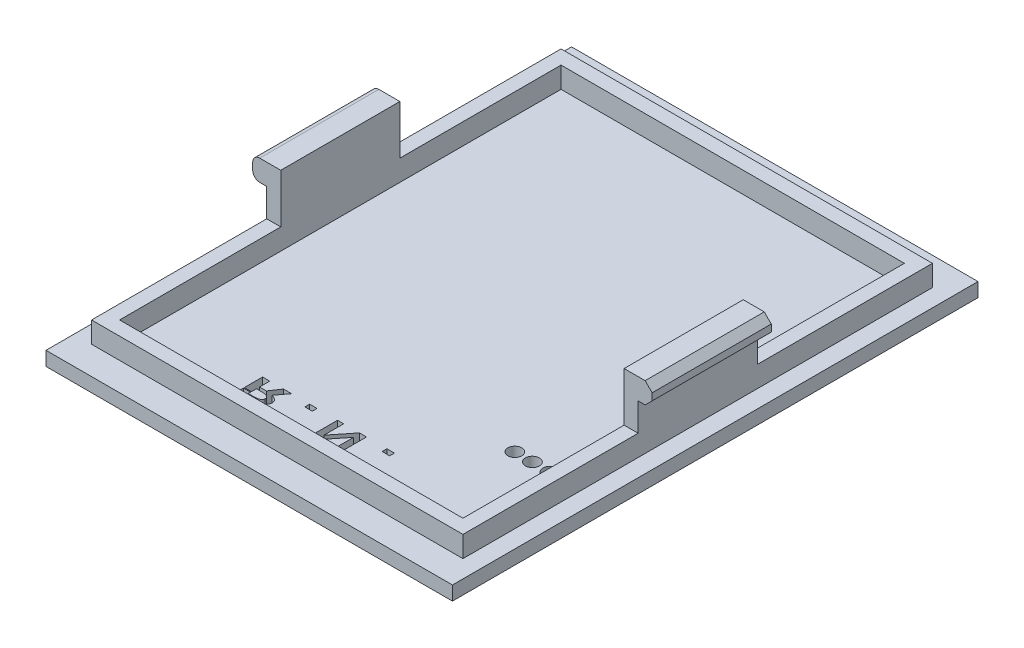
ISO-10303-21;
HEADER;
FILE_DESCRIPTION(('STEP AP214'),'2;1');
FILE_NAME('part.step','',(''),(''),'','','');
FILE_SCHEMA(('AUTOMOTIVE_DESIGN { 1 0 10303 214 1 1 1 1 }'));
ENDSEC;
DATA;
#1=APPLICATION_CONTEXT('core data for automotive mechanical design processes');
#2=APPLICATION_PROTOCOL_DEFINITION('international standard','automotive_design',2000,#1);
#3=PRODUCT_CONTEXT('',#1,'mechanical');
#4=PRODUCT('Part','Part','',(#3));
#5=PRODUCT_RELATED_PRODUCT_CATEGORY('part','',(#4));
#6=PRODUCT_DEFINITION_FORMATION('','',#4);
#7=PRODUCT_DEFINITION_CONTEXT('part definition',#1,'design');
#8=PRODUCT_DEFINITION('design','',#6,#7);
#9=PRODUCT_DEFINITION_SHAPE('','',#8);
#10=(LENGTH_UNIT() NAMED_UNIT(*) SI_UNIT(.MILLI.,.METRE.));
#11=(NAMED_UNIT(*) PLANE_ANGLE_UNIT() SI_UNIT($,.RADIAN.));
#12=(NAMED_UNIT(*) SI_UNIT($,.STERADIAN.) SOLID_ANGLE_UNIT());
#13=UNCERTAINTY_MEASURE_WITH_UNIT(LENGTH_MEASURE(1.E-05),#10,'distance_accuracy_value','');
#14=(GEOMETRIC_REPRESENTATION_CONTEXT(3) GLOBAL_UNCERTAINTY_ASSIGNED_CONTEXT((#13)) GLOBAL_UNIT_ASSIGNED_CONTEXT((#10,
#11,#12)) REPRESENTATION_CONTEXT('',''));
#15=CARTESIAN_POINT('',(0.,0.,0.));
#16=DIRECTION('',(0.,0.,1.));
#17=DIRECTION('',(1.,0.,0.));
#18=AXIS2_PLACEMENT_3D('',#15,#16,#17);
#19=CARTESIAN_POINT('',(18.752047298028,2.,-12.1557881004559));
#20=DIRECTION('',(1.,0.,0.));
#21=DIRECTION('',(0.,0.,-1.));
#22=AXIS2_PLACEMENT_3D('',#19,#20,#21);
#23=PLANE('',#22);
#24=DIRECTION('',(0.,-1.,0.));
#25=VECTOR('',#24,1.);
#26=CARTESIAN_POINT('',(18.752047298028,2.,-9.41733859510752));
#27=LINE('',#26,#25);
#28=CARTESIAN_POINT('',(18.752047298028,2.,-9.41733859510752));
#29=VERTEX_POINT('',#28);
#30=CARTESIAN_POINT('',(18.752047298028,0.,-9.41733859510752));
#31=VERTEX_POINT('',#30);
#32=EDGE_CURVE('E47',#29,#31,#27,.T.);
#33=ORIENTED_EDGE('',*,*,#32,.F.);
#34=DIRECTION('',(0.,0.,1.));
#35=VECTOR('',#34,1.);
#36=CARTESIAN_POINT('',(18.752047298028,2.,-12.1557881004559));
#37=LINE('',#36,#35);
#38=CARTESIAN_POINT('',(18.752047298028,2.,-8.65578810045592));
#39=VERTEX_POINT('',#38);
#40=EDGE_CURVE('E105',#29,#39,#37,.T.);
#41=ORIENTED_EDGE('',*,*,#40,.T.);
#42=DIRECTION('',(0.,-1.,0.));
#43=VECTOR('',#42,1.);
#44=CARTESIAN_POINT('',(18.752047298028,2.,-8.65578810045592));
#45=LINE('',#44,#43);
#46=CARTESIAN_POINT('',(18.752047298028,0.,-8.65578810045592));
#47=VERTEX_POINT('',#46);
#48=EDGE_CURVE('E628',#39,#47,#45,.T.);
#49=ORIENTED_EDGE('',*,*,#48,.T.);
#50=DIRECTION('',(0.,0.,1.));
#51=VECTOR('',#50,1.);
#52=CARTESIAN_POINT('',(18.752047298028,0.,-12.1557881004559));
#53=LINE('',#52,#51);
#54=EDGE_CURVE('E435',#31,#47,#53,.T.);
#55=ORIENTED_EDGE('',*,*,#54,.F.);
#56=EDGE_LOOP('',(#33,#41,#49,#55));
#57=FACE_BOUND('',#56,.T.);
#58=ADVANCED_FACE('F38',(#57),#23,.T.);
#59=CARTESIAN_POINT('',(0.,0.,0.));
#60=DIRECTION('',(0.,-1.,0.));
#61=DIRECTION('',(0.,0.,-1.));
#62=AXIS2_PLACEMENT_3D('',#59,#60,#61);
#63=PLANE('',#62);
#64=CARTESIAN_POINT('',(51.,0.,-20.9084786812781));
#65=DIRECTION('',(0.,-1.,0.));
#66=DIRECTION('',(0.,0.,-1.));
#67=AXIS2_PLACEMENT_3D('',#64,#65,#66);
#68=CIRCLE('',#67,0.999999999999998);
#69=CARTESIAN_POINT('',(51.,0.,-21.9084786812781));
#70=VERTEX_POINT('',#69);
#71=EDGE_CURVE('E1170',#70,#70,#68,.T.);
#72=ORIENTED_EDGE('',*,*,#71,.F.);
#73=EDGE_LOOP('',(#72));
#74=FACE_BOUND('',#73,.T.);
#75=CARTESIAN_POINT('',(46.,0.,-20.9084786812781));
#76=DIRECTION('',(0.,-1.,0.));
#77=DIRECTION('',(0.,0.,-1.));
#78=AXIS2_PLACEMENT_3D('',#75,#76,#77);
#79=CIRCLE('',#78,0.992008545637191);
#80=CARTESIAN_POINT('',(46.,0.,-21.9004872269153));
#81=VERTEX_POINT('',#80);
#82=EDGE_CURVE('E1838',#81,#81,#79,.T.);
#83=ORIENTED_EDGE('',*,*,#82,.F.);
#84=EDGE_LOOP('',(#83));
#85=FACE_BOUND('',#84,.T.);
#86=CARTESIAN_POINT('',(48.5,0.,-20.9084786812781));
#87=DIRECTION('',(0.,-1.,0.));
#88=DIRECTION('',(0.,0.,-1.));
#89=AXIS2_PLACEMENT_3D('',#86,#87,#88);
#90=CIRCLE('',#89,0.999999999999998);
#91=CARTESIAN_POINT('',(48.5,0.,-21.9084786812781));
#92=VERTEX_POINT('',#91);
#93=EDGE_CURVE('E1832',#92,#92,#90,.T.);
#94=ORIENTED_EDGE('',*,*,#93,.F.);
#95=EDGE_LOOP('',(#94));
#96=FACE_BOUND('',#95,.T.);
#97=DIRECTION('',(1.,0.,0.));
#98=VECTOR('',#97,1.);
#99=CARTESIAN_POINT('',(18.6655021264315,0.,-9.54101877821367));
#100=LINE('',#99,#98);
#101=CARTESIAN_POINT('',(18.752047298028,0.,-9.54101877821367));
#102=VERTEX_POINT('',#101);
#103=CARTESIAN_POINT('',(19.7728806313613,0.,-9.54101877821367));
#104=VERTEX_POINT('',#103);
#105=EDGE_CURVE('E558',#102,#104,#100,.T.);
#106=ORIENTED_EDGE('',*,*,#105,.T.);
#107=DIRECTION('',(0.,0.,-1.));
#108=VECTOR('',#107,1.);
#109=CARTESIAN_POINT('',(19.7728806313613,0.,-9.09328810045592));
#110=LINE('',#109,#108);
#111=CARTESIAN_POINT('',(19.7728806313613,0.,-10.2599547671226));
#112=VERTEX_POINT('',#111);
#113=EDGE_CURVE('E1165',#104,#112,#110,.T.);
#114=ORIENTED_EDGE('',*,*,#113,.T.);
#115=DIRECTION('',(1.,0.,0.));
#116=VECTOR('',#115,1.);
#117=CARTESIAN_POINT('',(19.7728806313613,0.,-10.2599547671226));
#118=LINE('',#117,#116);
#119=CARTESIAN_POINT('',(20.5757235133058,0.,-10.2599547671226));
#120=VERTEX_POINT('',#119);
#121=EDGE_CURVE('E1155',#112,#120,#118,.T.);
#122=ORIENTED_EDGE('',*,*,#121,.T.);
#123=CARTESIAN_POINT('',(20.5757235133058,0.,-10.2599547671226));
#124=CARTESIAN_POINT('',(20.6190356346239,0.,-10.259696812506));
#125=CARTESIAN_POINT('',(20.7029631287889,0.,-10.2591969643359));
#126=CARTESIAN_POINT('',(20.824326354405,0.,-10.2502823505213));
#127=CARTESIAN_POINT('',(20.9369757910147,0.,-10.2379445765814));
#128=CARTESIAN_POINT('',(21.0405392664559,0.,-10.2198710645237));
#129=CARTESIAN_POINT('',(21.1352755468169,0.,-10.1964166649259));
#130=CARTESIAN_POINT('',(21.221290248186,0.,-10.1678283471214));
#131=CARTESIAN_POINT('',(21.2986035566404,0.,-10.1338646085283));
#132=CARTESIAN_POINT('',(21.3664865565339,0.,-10.0940268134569));
#133=CARTESIAN_POINT('',(21.4263141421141,0.,-10.0505320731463));
#134=CARTESIAN_POINT('',(21.4782221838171,0.,-10.0035608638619));
#135=CARTESIAN_POINT('',(21.5218984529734,0.,-9.95292264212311));
#136=CARTESIAN_POINT('',(21.5581452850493,0.,-9.89963743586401));
#137=CARTESIAN_POINT('',(21.5856683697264,0.,-9.84271564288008));
#138=CARTESIAN_POINT('',(21.6054391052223,0.,-9.78298118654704));
#139=CARTESIAN_POINT('',(21.6182723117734,0.,-9.71995411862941));
#140=CARTESIAN_POINT('',(21.6194841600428,0.,-9.67668501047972));
#141=CARTESIAN_POINT('',(21.6201028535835,0.,-9.65459452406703));
#142=B_SPLINE_CURVE_WITH_KNOTS('',3,(#123,#124,#125,#126,#127,#128,#129,#130,#131,#132,#133,
#134,#135,#136,#137,#138,#139,#140,#141),.UNSPECIFIED.,.F.,.F.,(4,1,1,1,1,1,1,1,1,1,1,1,1,1,1,1,
4),(0.,0.0963792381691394,0.186757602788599,0.270709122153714,0.348534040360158,
0.420562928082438,0.487746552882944,0.550057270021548,0.608145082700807,0.662586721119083,
0.714444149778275,0.763588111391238,0.811102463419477,0.857476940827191,0.903810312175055,
0.950891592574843,1.),.UNSPECIFIED.);
#143=CARTESIAN_POINT('',(21.6201028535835,0.,-9.65459452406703));
#144=VERTEX_POINT('',#143);
#145=EDGE_CURVE('E1146',#120,#144,#142,.T.);
#146=ORIENTED_EDGE('',*,*,#145,.T.);
#147=CARTESIAN_POINT('',(21.6201028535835,0.,-9.65459452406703));
#148=CARTESIAN_POINT('',(21.6194572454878,0.,-9.63200614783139));
#149=CARTESIAN_POINT('',(21.6181923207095,0.,-9.58774927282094));
#150=CARTESIAN_POINT('',(21.6058098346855,0.,-9.52351078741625));
#151=CARTESIAN_POINT('',(21.5851542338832,0.,-9.46374130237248));
#152=CARTESIAN_POINT('',(21.5566244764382,0.,-9.40818500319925));
#153=CARTESIAN_POINT('',(21.5201719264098,0.,-9.35685303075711));
#154=CARTESIAN_POINT('',(21.4742508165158,0.,-9.31125088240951));
#155=CARTESIAN_POINT('',(21.4216210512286,0.,-9.26889036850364));
#156=CARTESIAN_POINT('',(21.3601289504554,0.,-9.23219410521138));
#157=CARTESIAN_POINT('',(21.2916396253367,0.,-9.19818799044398));
#158=CARTESIAN_POINT('',(21.2141140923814,0.,-9.17077848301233));
#159=CARTESIAN_POINT('',(21.1289688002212,0.,-9.14628143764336));
#160=CARTESIAN_POINT('',(21.0354943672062,0.,-9.1269403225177));
#161=CARTESIAN_POINT('',(20.9340673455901,0.,-9.11172663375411));
#162=CARTESIAN_POINT('',(20.8247587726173,0.,-9.1016420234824));
#163=CARTESIAN_POINT('',(20.707474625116,0.,-9.094409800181));
#164=CARTESIAN_POINT('',(20.6266255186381,0.,-9.09367031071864));
#165=CARTESIAN_POINT('',(20.5848380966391,0.,-9.09328810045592));
#166=B_SPLINE_CURVE_WITH_KNOTS('',3,(#147,#148,#149,#150,#151,#152,#153,#154,#155,#156,#157,
#158,#159,#160,#161,#162,#163,#164,#165),.UNSPECIFIED.,.F.,.F.,(4,1,1,1,1,1,1,1,1,1,1,1,1,1,1,1,
4),(0.,0.0513726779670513,0.100653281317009,0.148222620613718,0.194875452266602,
0.242374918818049,0.290870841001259,0.341723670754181,0.39578963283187,0.45352451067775,
0.515514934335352,0.582644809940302,0.65509761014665,0.732608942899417,0.815989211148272,
0.904892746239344,1.),.UNSPECIFIED.);
#167=CARTESIAN_POINT('',(20.5848380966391,0.,-9.09328810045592));
#168=VERTEX_POINT('',#167);
#169=EDGE_CURVE('E1139',#144,#168,#166,.T.);
#170=ORIENTED_EDGE('',*,*,#169,.T.);
#171=DIRECTION('',(-1.,0.,0.));
#172=VECTOR('',#171,1.);
#173=CARTESIAN_POINT('',(20.5848380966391,0.,-9.09328810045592));
#174=LINE('',#173,#172);
#175=CARTESIAN_POINT('',(19.7728806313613,0.,-9.09328810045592));
#176=VERTEX_POINT('',#175);
#177=EDGE_CURVE('E1166',#168,#176,#174,.T.);
#178=ORIENTED_EDGE('',*,*,#177,.T.);
#179=CARTESIAN_POINT('',(19.7728806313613,0.,-9.41733859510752));
#180=VERTEX_POINT('',#179);
#181=EDGE_CURVE('E1162',#176,#180,#110,.T.);
#182=ORIENTED_EDGE('',*,*,#181,.T.);
#183=DIRECTION('',(-1.,0.,0.));
#184=VECTOR('',#183,1.);
#185=CARTESIAN_POINT('',(18.6655021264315,0.,-9.41733859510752));
#186=LINE('',#185,#184);
#187=EDGE_CURVE('E54',#180,#31,#186,.T.);
#188=ORIENTED_EDGE('',*,*,#187,.T.);
#189=ORIENTED_EDGE('',*,*,#54,.T.);
#190=DIRECTION('',(1.,0.,0.));
#191=VECTOR('',#190,1.);
#192=CARTESIAN_POINT('',(18.752047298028,0.,-8.65578810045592));
#193=LINE('',#192,#191);
#194=CARTESIAN_POINT('',(20.6410446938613,0.,-8.65578810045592));
#195=VERTEX_POINT('',#194);
#196=EDGE_CURVE('E414',#47,#195,#193,.T.);
#197=ORIENTED_EDGE('',*,*,#196,.T.);
#198=CARTESIAN_POINT('',(20.6410446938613,0.,-8.65578810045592));
#199=CARTESIAN_POINT('',(20.7235964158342,0.,-8.6564237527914));
#200=CARTESIAN_POINT('',(20.8834792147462,0.,-8.65765485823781));
#201=CARTESIAN_POINT('',(21.1148599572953,0.,-8.66971253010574));
#202=CARTESIAN_POINT('',(21.3294593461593,0.,-8.69025286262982));
#203=CARTESIAN_POINT('',(21.5274786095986,0.,-8.71730894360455));
#204=CARTESIAN_POINT('',(21.7080964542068,0.,-8.75492771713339));
#205=CARTESIAN_POINT('',(21.8728010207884,0.,-8.79806585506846));
#206=CARTESIAN_POINT('',(22.0201531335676,0.,-8.85108112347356));
#207=CARTESIAN_POINT('',(22.1513831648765,0.,-8.9116993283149));
#208=CARTESIAN_POINT('',(22.2661005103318,0.,-8.98067009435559));
#209=CARTESIAN_POINT('',(22.3669116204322,0.,-9.05528963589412));
#210=CARTESIAN_POINT('',(22.4507755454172,0.,-9.13918749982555));
#211=CARTESIAN_POINT('',(22.5218380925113,0.,-9.22842492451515));
#212=CARTESIAN_POINT('',(22.5748753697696,0.,-9.32671955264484));
#213=CARTESIAN_POINT('',(22.613480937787,0.,-9.43149308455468));
#214=CARTESIAN_POINT('',(22.6367969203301,0.,-9.54343711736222));
#215=CARTESIAN_POINT('',(22.6395376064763,0.,-9.62055690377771));
#216=CARTESIAN_POINT('',(22.6409361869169,0.,-9.65991136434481));
#217=B_SPLINE_CURVE_WITH_KNOTS('',3,(#198,#199,#200,#201,#202,#203,#204,#205,#206,#207,#208,
#209,#210,#211,#212,#213,#214,#215,#216),.UNSPECIFIED.,.F.,.F.,(4,1,1,1,1,1,1,1,1,1,1,1,1,1,1,1,
4),(0.,0.0995400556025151,0.192785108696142,0.279273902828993,0.35945207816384,
0.433637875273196,0.501624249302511,0.564590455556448,0.622227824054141,0.675633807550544,
0.725764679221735,0.773043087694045,0.818295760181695,0.862836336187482,0.907074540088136,
0.9525798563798,1.),.UNSPECIFIED.);
#218=CARTESIAN_POINT('',(22.6409361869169,0.,-9.65991136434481));
#219=VERTEX_POINT('',#218);
#220=EDGE_CURVE('E423',#195,#219,#217,.T.);
#221=ORIENTED_EDGE('',*,*,#220,.T.);
#222=CARTESIAN_POINT('',(22.6409361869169,0.,-9.65991136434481));
#223=CARTESIAN_POINT('',(22.6402655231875,0.,-9.68654416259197));
#224=CARTESIAN_POINT('',(22.6389497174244,0.,-9.7387962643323));
#225=CARTESIAN_POINT('',(22.6267921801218,0.,-9.8155321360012));
#226=CARTESIAN_POINT('',(22.6089795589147,0.,-9.88948564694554));
#227=CARTESIAN_POINT('',(22.5828988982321,0.,-9.96052901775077));
#228=CARTESIAN_POINT('',(22.5493094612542,0.,-10.0285314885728));
#229=CARTESIAN_POINT('',(22.5079627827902,0.,-10.0932038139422));
#230=CARTESIAN_POINT('',(22.4595617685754,0.,-10.1551344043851));
#231=CARTESIAN_POINT('',(22.404305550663,0.,-10.2148748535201));
#232=CARTESIAN_POINT('',(22.3396925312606,0.,-10.2694950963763));
#233=CARTESIAN_POINT('',(22.2696921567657,0.,-10.3235871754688));
#234=CARTESIAN_POINT('',(22.1914611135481,0.,-10.3732546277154));
#235=CARTESIAN_POINT('',(22.1056413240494,0.,-10.4195334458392));
#236=CARTESIAN_POINT('',(22.0130010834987,0.,-10.4637704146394));
#237=CARTESIAN_POINT('',(21.9123192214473,0.,-10.504337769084));
#238=CARTESIAN_POINT('',(21.8049083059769,0.,-10.5435080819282));
#239=CARTESIAN_POINT('',(21.7298677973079,0.,-10.5654618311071));
#240=CARTESIAN_POINT('',(21.691500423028,0.,-10.5766865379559));
#241=B_SPLINE_CURVE_WITH_KNOTS('',3,(#222,#223,#224,#225,#226,#227,#228,#229,#230,#231,#232,
#233,#234,#235,#236,#237,#238,#239,#240),.UNSPECIFIED.,.F.,.F.,(4,1,1,1,1,1,1,1,1,1,1,1,1,1,1,1,
4),(0.,0.0559796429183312,0.109829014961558,0.163042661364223,0.215774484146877,
0.268645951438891,0.322273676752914,0.376920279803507,0.433811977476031,0.493076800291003,
0.55463943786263,0.619785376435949,0.687701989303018,0.759639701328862,0.835589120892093,
0.915938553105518,1.),.UNSPECIFIED.);
#242=CARTESIAN_POINT('',(21.691500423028,0.,-10.5766865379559));
#243=VERTEX_POINT('',#242);
#244=EDGE_CURVE('E430',#219,#243,#241,.T.);
#245=ORIENTED_EDGE('',*,*,#244,.T.);
#246=DIRECTION('',(0.602637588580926,0.,-0.79801499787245));
#247=VECTOR('',#246,1.);
#248=CARTESIAN_POINT('',(21.691500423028,0.,-10.5766865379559));
#249=LINE('',#248,#247);
#250=CARTESIAN_POINT('',(22.8839917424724,0.,-12.1557881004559));
#251=VERTEX_POINT('',#250);
#252=EDGE_CURVE('E590',#243,#251,#249,.T.);
#253=ORIENTED_EDGE('',*,*,#252,.T.);
#254=DIRECTION('',(-1.,0.,0.));
#255=VECTOR('',#254,1.);
#256=CARTESIAN_POINT('',(22.8839917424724,0.,-12.1557881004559));
#257=LINE('',#256,#255);
#258=CARTESIAN_POINT('',(21.7264396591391,0.,-12.1557881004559));
#259=VERTEX_POINT('',#258);
#260=EDGE_CURVE('E586',#251,#259,#257,.T.);
#261=ORIENTED_EDGE('',*,*,#260,.T.);
#262=DIRECTION('',(-0.557987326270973,0.,0.829849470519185));
#263=VECTOR('',#262,1.);
#264=CARTESIAN_POINT('',(21.7264396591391,0.,-12.1557881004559));
#265=LINE('',#264,#263);
#266=CARTESIAN_POINT('',(20.7458624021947,0.,-10.6974547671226));
#267=VERTEX_POINT('',#266);
#268=EDGE_CURVE('E582',#259,#267,#265,.T.);
#269=ORIENTED_EDGE('',*,*,#268,.T.);
#270=DIRECTION('',(-1.,0.,0.));
#271=VECTOR('',#270,1.);
#272=CARTESIAN_POINT('',(20.7458624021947,0.,-10.6974547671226));
#273=LINE('',#272,#271);
#274=CARTESIAN_POINT('',(19.7728806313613,0.,-10.6974547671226));
#275=VERTEX_POINT('',#274);
#276=EDGE_CURVE('E579',#267,#275,#273,.T.);
#277=ORIENTED_EDGE('',*,*,#276,.T.);
#278=DIRECTION('',(0.,0.,-1.));
#279=VECTOR('',#278,1.);
#280=CARTESIAN_POINT('',(19.7728806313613,0.,-10.6974547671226));
#281=LINE('',#280,#279);
#282=CARTESIAN_POINT('',(19.7728806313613,0.,-12.1557881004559));
#283=VERTEX_POINT('',#282);
#284=EDGE_CURVE('E564',#275,#283,#281,.T.);
#285=ORIENTED_EDGE('',*,*,#284,.T.);
#286=DIRECTION('',(-1.,0.,0.));
#287=VECTOR('',#286,1.);
#288=CARTESIAN_POINT('',(19.7728806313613,0.,-12.1557881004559));
#289=LINE('',#288,#287);
#290=CARTESIAN_POINT('',(18.752047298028,0.,-12.1557881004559));
#291=VERTEX_POINT('',#290);
#292=EDGE_CURVE('E561',#283,#291,#289,.T.);
#293=ORIENTED_EDGE('',*,*,#292,.T.);
#294=EDGE_CURVE('E113',#291,#102,#53,.T.);
#295=ORIENTED_EDGE('',*,*,#294,.T.);
#296=EDGE_LOOP('',(#106,#114,#122,#146,#170,#178,#182,#188,#189,#197,#221,#245,#253,#261,#269,
#277,#285,#293,#295));
#297=FACE_BOUND('',#296,.T.);
#298=DIRECTION('',(-1.,0.,0.));
#299=VECTOR('',#298,1.);
#300=CARTESIAN_POINT('',(26.5298250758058,0.,-12.1557881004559));
#301=LINE('',#300,#299);
#302=CARTESIAN_POINT('',(26.5298250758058,0.,-12.1557881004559));
#303=VERTEX_POINT('',#302);
#304=CARTESIAN_POINT('',(25.4603806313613,0.,-12.1557881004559));
#305=VERTEX_POINT('',#304);
#306=EDGE_CURVE('E654',#303,#305,#301,.T.);
#307=ORIENTED_EDGE('',*,*,#306,.T.);
#308=DIRECTION('',(0.,0.,1.));
#309=VECTOR('',#308,1.);
#310=CARTESIAN_POINT('',(25.4603806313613,0.,-12.1557881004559));
#311=LINE('',#310,#309);
#312=CARTESIAN_POINT('',(25.4603806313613,0.,-11.4752325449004));
#313=VERTEX_POINT('',#312);
#314=EDGE_CURVE('E649',#305,#313,#311,.T.);
#315=ORIENTED_EDGE('',*,*,#314,.T.);
#316=DIRECTION('',(1.,0.,0.));
#317=VECTOR('',#316,1.);
#318=CARTESIAN_POINT('',(25.4603806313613,0.,-11.4752325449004));
#319=LINE('',#318,#317);
#320=CARTESIAN_POINT('',(26.5298250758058,0.,-11.4752325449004));
#321=VERTEX_POINT('',#320);
#322=EDGE_CURVE('E653',#313,#321,#319,.T.);
#323=ORIENTED_EDGE('',*,*,#322,.T.);
#324=DIRECTION('',(0.,0.,-1.));
#325=VECTOR('',#324,1.);
#326=CARTESIAN_POINT('',(26.5298250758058,0.,-11.4752325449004));
#327=LINE('',#326,#325);
#328=EDGE_CURVE('E658',#321,#303,#327,.T.);
#329=ORIENTED_EDGE('',*,*,#328,.T.);
#330=EDGE_LOOP('',(#307,#315,#323,#329));
#331=FACE_BOUND('',#330,.T.);
#332=DIRECTION('',(-1.,0.,0.));
#333=VECTOR('',#332,1.);
#334=CARTESIAN_POINT('',(30.3214917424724,0.,-12.1557881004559));
#335=LINE('',#334,#333);
#336=CARTESIAN_POINT('',(30.3214917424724,0.,-12.1557881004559));
#337=VERTEX_POINT('',#336);
#338=CARTESIAN_POINT('',(29.4464917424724,0.,-12.1557881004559));
#339=VERTEX_POINT('',#338);
#340=EDGE_CURVE('E662',#337,#339,#335,.T.);
#341=ORIENTED_EDGE('',*,*,#340,.T.);
#342=DIRECTION('',(0.,0.,1.));
#343=VECTOR('',#342,1.);
#344=CARTESIAN_POINT('',(29.4464917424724,0.,-12.1557881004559));
#345=LINE('',#344,#343);
#346=CARTESIAN_POINT('',(29.4464917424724,0.,-8.65578810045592));
#347=VERTEX_POINT('',#346);
#348=EDGE_CURVE('E718',#339,#347,#345,.T.);
#349=ORIENTED_EDGE('',*,*,#348,.T.);
#350=DIRECTION('',(1.,0.,0.));
#351=VECTOR('',#350,1.);
#352=CARTESIAN_POINT('',(29.4464917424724,0.,-8.65578810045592));
#353=LINE('',#352,#351);
#354=CARTESIAN_POINT('',(30.6799986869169,0.,-8.65578810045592));
#355=VERTEX_POINT('',#354);
#356=EDGE_CURVE('E722',#347,#355,#353,.T.);
#357=ORIENTED_EDGE('',*,*,#356,.T.);
#358=DIRECTION('',(0.62561106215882,0.,-0.780135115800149));
#359=VECTOR('',#358,1.);
#360=CARTESIAN_POINT('',(30.6799986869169,0.,-8.65578810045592));
#361=LINE('',#360,#359);
#362=CARTESIAN_POINT('',(32.7034361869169,0.,-11.179008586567));
#363=VERTEX_POINT('',#362);
#364=EDGE_CURVE('E726',#355,#363,#361,.T.);
#365=ORIENTED_EDGE('',*,*,#364,.T.);
#366=DIRECTION('',(0.,0.,1.));
#367=VECTOR('',#366,1.);
#368=CARTESIAN_POINT('',(32.7034361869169,0.,-11.179008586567));
#369=LINE('',#368,#367);
#370=CARTESIAN_POINT('',(32.7034361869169,0.,-8.65578810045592));
#371=VERTEX_POINT('',#370);
#372=EDGE_CURVE('E730',#363,#371,#369,.T.);
#373=ORIENTED_EDGE('',*,*,#372,.T.);
#374=DIRECTION('',(1.,0.,0.));
#375=VECTOR('',#374,1.);
#376=CARTESIAN_POINT('',(32.7034361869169,0.,-8.65578810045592));
#377=LINE('',#376,#375);
#378=CARTESIAN_POINT('',(33.5784361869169,0.,-8.65578810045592));
#379=VERTEX_POINT('',#378);
#380=EDGE_CURVE('E734',#371,#379,#377,.T.);
#381=ORIENTED_EDGE('',*,*,#380,.T.);
#382=DIRECTION('',(0.,0.,-1.));
#383=VECTOR('',#382,1.);
#384=CARTESIAN_POINT('',(33.5784361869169,0.,-8.65578810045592));
#385=LINE('',#384,#383);
#386=CARTESIAN_POINT('',(33.5784361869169,0.,-12.1557881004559));
#387=VERTEX_POINT('',#386);
#388=EDGE_CURVE('E738',#379,#387,#385,.T.);
#389=ORIENTED_EDGE('',*,*,#388,.T.);
#390=DIRECTION('',(-1.,0.,0.));
#391=VECTOR('',#390,1.);
#392=CARTESIAN_POINT('',(33.5784361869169,0.,-12.1557881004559));
#393=LINE('',#392,#391);
#394=CARTESIAN_POINT('',(32.5697556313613,0.,-12.1557881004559));
#395=VERTEX_POINT('',#394);
#396=EDGE_CURVE('E742',#387,#395,#393,.T.);
#397=ORIENTED_EDGE('',*,*,#396,.T.);
#398=DIRECTION('',(-0.625725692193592,0.,0.780043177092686));
#399=VECTOR('',#398,1.);
#400=CARTESIAN_POINT('',(32.5697556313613,0.,-12.1557881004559));
#401=LINE('',#400,#399);
#402=CARTESIAN_POINT('',(30.3214917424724,0.,-9.35305372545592));
#403=VERTEX_POINT('',#402);
#404=EDGE_CURVE('E746',#395,#403,#401,.T.);
#405=ORIENTED_EDGE('',*,*,#404,.T.);
#406=DIRECTION('',(0.,0.,-1.));
#407=VECTOR('',#406,1.);
#408=CARTESIAN_POINT('',(30.3214917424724,0.,-9.35305372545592));
#409=LINE('',#408,#407);
#410=EDGE_CURVE('E750',#403,#337,#409,.T.);
#411=ORIENTED_EDGE('',*,*,#410,.T.);
#412=EDGE_LOOP('',(#341,#349,#357,#365,#373,#381,#389,#397,#405,#411));
#413=FACE_BOUND('',#412,.T.);
#414=DIRECTION('',(-1.,0.,0.));
#415=VECTOR('',#414,1.);
#416=CARTESIAN_POINT('',(37.564547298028,0.,-12.1557881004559));
#417=LINE('',#416,#415);
#418=CARTESIAN_POINT('',(37.564547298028,0.,-12.1557881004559));
#419=VERTEX_POINT('',#418);
#420=CARTESIAN_POINT('',(36.4951028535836,0.,-12.1557881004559));
#421=VERTEX_POINT('',#420);
#422=EDGE_CURVE('E754',#419,#421,#417,.T.);
#423=ORIENTED_EDGE('',*,*,#422,.T.);
#424=DIRECTION('',(0.,0.,1.));
#425=VECTOR('',#424,1.);
#426=CARTESIAN_POINT('',(36.4951028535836,0.,-12.1557881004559));
#427=LINE('',#426,#425);
#428=CARTESIAN_POINT('',(36.4951028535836,0.,-11.4752325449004));
#429=VERTEX_POINT('',#428);
#430=EDGE_CURVE('E797',#421,#429,#427,.T.);
#431=ORIENTED_EDGE('',*,*,#430,.T.);
#432=DIRECTION('',(1.,0.,0.));
#433=VECTOR('',#432,1.);
#434=CARTESIAN_POINT('',(36.4951028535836,0.,-11.4752325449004));
#435=LINE('',#434,#433);
#436=CARTESIAN_POINT('',(37.564547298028,0.,-11.4752325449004));
#437=VERTEX_POINT('',#436);
#438=EDGE_CURVE('E571',#429,#437,#435,.T.);
#439=ORIENTED_EDGE('',*,*,#438,.T.);
#440=DIRECTION('',(0.,0.,-1.));
#441=VECTOR('',#440,1.);
#442=CARTESIAN_POINT('',(37.564547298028,0.,-11.4752325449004));
#443=LINE('',#442,#441);
#444=EDGE_CURVE('E566',#437,#419,#443,.T.);
#445=ORIENTED_EDGE('',*,*,#444,.T.);
#446=EDGE_LOOP('',(#423,#431,#439,#445));
#447=FACE_BOUND('',#446,.T.);
#448=DIRECTION('',(0.,0.,1.));
#449=VECTOR('',#448,1.);
#450=CARTESIAN_POINT('',(0.,0.,0.));
#451=LINE('',#450,#449);
#452=CARTESIAN_POINT('',(0.,0.,-75.));
#453=VERTEX_POINT('',#452);
#454=CARTESIAN_POINT('',(0.,0.,0.));
#455=VERTEX_POINT('',#454);
#456=EDGE_CURVE('E1040',#453,#455,#451,.T.);
#457=ORIENTED_EDGE('',*,*,#456,.F.);
#458=DIRECTION('',(-1.,0.,0.));
#459=VECTOR('',#458,1.);
#460=CARTESIAN_POINT('',(0.,0.,-75.));
#461=LINE('',#460,#459);
#462=CARTESIAN_POINT('',(58.,0.,-75.));
#463=VERTEX_POINT('',#462);
#464=EDGE_CURVE('E1053',#463,#453,#461,.T.);
#465=ORIENTED_EDGE('',*,*,#464,.F.);
#466=DIRECTION('',(0.,0.,-1.));
#467=VECTOR('',#466,1.);
#468=CARTESIAN_POINT('',(58.,0.,0.));
#469=LINE('',#468,#467);
#470=CARTESIAN_POINT('',(58.,0.,0.));
#471=VERTEX_POINT('',#470);
#472=EDGE_CURVE('E1049',#471,#463,#469,.T.);
#473=ORIENTED_EDGE('',*,*,#472,.F.);
#474=DIRECTION('',(1.,0.,0.));
#475=VECTOR('',#474,1.);
#476=CARTESIAN_POINT('',(0.,0.,0.));
#477=LINE('',#476,#475);
#478=EDGE_CURVE('E1045',#455,#471,#477,.T.);
#479=ORIENTED_EDGE('',*,*,#478,.F.);
#480=EDGE_LOOP('',(#457,#465,#473,#479));
#481=FACE_BOUND('',#480,.T.);
#482=ADVANCED_FACE('F40',(#74,#85,#96,#297,#331,#413,#447,#481),#63,.T.);
#483=CARTESIAN_POINT('',(0.,2.,0.));
#484=DIRECTION('',(0.,-1.,0.));
#485=DIRECTION('',(0.,0.,-1.));
#486=AXIS2_PLACEMENT_3D('',#483,#484,#485);
#487=PLANE('',#486);
#488=CARTESIAN_POINT('',(51.,2.,-20.9084786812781));
#489=DIRECTION('',(0.,1.,0.));
#490=DIRECTION('',(0.,0.,1.));
#491=AXIS2_PLACEMENT_3D('',#488,#489,#490);
#492=CIRCLE('',#491,0.999999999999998);
#493=CARTESIAN_POINT('',(51.,2.,-19.9084786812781));
#494=VERTEX_POINT('',#493);
#495=EDGE_CURVE('E1830',#494,#494,#492,.T.);
#496=ORIENTED_EDGE('',*,*,#495,.F.);
#497=EDGE_LOOP('',(#496));
#498=FACE_BOUND('',#497,.T.);
#499=CARTESIAN_POINT('',(46.,2.,-20.9084786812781));
#500=DIRECTION('',(0.,1.,0.));
#501=DIRECTION('',(0.,0.,1.));
#502=AXIS2_PLACEMENT_3D('',#499,#500,#501);
#503=CIRCLE('',#502,0.992008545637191);
#504=CARTESIAN_POINT('',(46.,2.,-19.9164701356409));
#505=VERTEX_POINT('',#504);
#506=EDGE_CURVE('E1833',#505,#505,#503,.T.);
#507=ORIENTED_EDGE('',*,*,#506,.F.);
#508=EDGE_LOOP('',(#507));
#509=FACE_BOUND('',#508,.T.);
#510=CARTESIAN_POINT('',(48.5,2.,-20.9084786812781));
#511=DIRECTION('',(0.,1.,0.));
#512=DIRECTION('',(0.,0.,1.));
#513=AXIS2_PLACEMENT_3D('',#510,#511,#512);
#514=CIRCLE('',#513,0.999999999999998);
#515=CARTESIAN_POINT('',(48.5,2.,-19.9084786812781));
#516=VERTEX_POINT('',#515);
#517=EDGE_CURVE('E1841',#516,#516,#514,.T.);
#518=ORIENTED_EDGE('',*,*,#517,.F.);
#519=EDGE_LOOP('',(#518));
#520=FACE_BOUND('',#519,.T.);
#521=DIRECTION('',(0.,0.,1.));
#522=VECTOR('',#521,1.);
#523=CARTESIAN_POINT('',(25.4603806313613,2.,-12.1557881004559));
#524=LINE('',#523,#522);
#525=CARTESIAN_POINT('',(25.4603806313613,2.,-12.1557881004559));
#526=VERTEX_POINT('',#525);
#527=CARTESIAN_POINT('',(25.4603806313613,2.,-11.4752325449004));
#528=VERTEX_POINT('',#527);
#529=EDGE_CURVE('E631',#526,#528,#524,.T.);
#530=ORIENTED_EDGE('',*,*,#529,.F.);
#531=DIRECTION('',(-1.,0.,0.));
#532=VECTOR('',#531,1.);
#533=CARTESIAN_POINT('',(26.5298250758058,2.,-12.1557881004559));
#534=LINE('',#533,#532);
#535=CARTESIAN_POINT('',(26.5298250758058,2.,-12.1557881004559));
#536=VERTEX_POINT('',#535);
#537=EDGE_CURVE('E645',#536,#526,#534,.T.);
#538=ORIENTED_EDGE('',*,*,#537,.F.);
#539=DIRECTION('',(0.,0.,-1.));
#540=VECTOR('',#539,1.);
#541=CARTESIAN_POINT('',(26.5298250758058,2.,-11.4752325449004));
#542=LINE('',#541,#540);
#543=CARTESIAN_POINT('',(26.5298250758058,2.,-11.4752325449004));
#544=VERTEX_POINT('',#543);
#545=EDGE_CURVE('E640',#544,#536,#542,.T.);
#546=ORIENTED_EDGE('',*,*,#545,.F.);
#547=DIRECTION('',(1.,0.,0.));
#548=VECTOR('',#547,1.);
#549=CARTESIAN_POINT('',(25.4603806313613,2.,-11.4752325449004));
#550=LINE('',#549,#548);
#551=EDGE_CURVE('E636',#528,#544,#550,.T.);
#552=ORIENTED_EDGE('',*,*,#551,.F.);
#553=EDGE_LOOP('',(#530,#538,#546,#552));
#554=FACE_BOUND('',#553,.T.);
#555=DIRECTION('',(0.,0.,1.));
#556=VECTOR('',#555,1.);
#557=CARTESIAN_POINT('',(36.4951028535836,2.,-12.1557881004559));
#558=LINE('',#557,#556);
#559=CARTESIAN_POINT('',(36.4951028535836,2.,-12.1557881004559));
#560=VERTEX_POINT('',#559);
#561=CARTESIAN_POINT('',(36.4951028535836,2.,-11.4752325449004));
#562=VERTEX_POINT('',#561);
#563=EDGE_CURVE('E780',#560,#562,#558,.T.);
#564=ORIENTED_EDGE('',*,*,#563,.F.);
#565=DIRECTION('',(-1.,0.,0.));
#566=VECTOR('',#565,1.);
#567=CARTESIAN_POINT('',(37.564547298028,2.,-12.1557881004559));
#568=LINE('',#567,#566);
#569=CARTESIAN_POINT('',(37.564547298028,2.,-12.1557881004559));
#570=VERTEX_POINT('',#569);
#571=EDGE_CURVE('E794',#570,#560,#568,.T.);
#572=ORIENTED_EDGE('',*,*,#571,.F.);
#573=DIRECTION('',(0.,0.,-1.));
#574=VECTOR('',#573,1.);
#575=CARTESIAN_POINT('',(37.564547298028,2.,-11.4752325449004));
#576=LINE('',#575,#574);
#577=CARTESIAN_POINT('',(37.564547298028,2.,-11.4752325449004));
#578=VERTEX_POINT('',#577);
#579=EDGE_CURVE('E789',#578,#570,#576,.T.);
#580=ORIENTED_EDGE('',*,*,#579,.F.);
#581=DIRECTION('',(1.,0.,0.));
#582=VECTOR('',#581,1.);
#583=CARTESIAN_POINT('',(36.4951028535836,2.,-11.4752325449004));
#584=LINE('',#583,#582);
#585=EDGE_CURVE('E785',#562,#578,#584,.T.);
#586=ORIENTED_EDGE('',*,*,#585,.F.);
#587=EDGE_LOOP('',(#564,#572,#580,#586));
#588=FACE_BOUND('',#587,.T.);
#589=DIRECTION('',(0.,0.,1.));
#590=VECTOR('',#589,1.);
#591=CARTESIAN_POINT('',(4.5,2.,-6.));
#592=LINE('',#591,#590);
#593=CARTESIAN_POINT('',(4.5,2.,-69.));
#594=VERTEX_POINT('',#593);
#595=CARTESIAN_POINT('',(4.5,2.,-6.));
#596=VERTEX_POINT('',#595);
#597=EDGE_CURVE('E578',#594,#596,#592,.T.);
#598=ORIENTED_EDGE('',*,*,#597,.T.);
#599=DIRECTION('',(1.,0.,0.));
#600=VECTOR('',#599,1.);
#601=CARTESIAN_POINT('',(4.5,2.,-6.));
#602=LINE('',#601,#600);
#603=CARTESIAN_POINT('',(53.5,2.,-6.));
#604=VERTEX_POINT('',#603);
#605=EDGE_CURVE('E941',#596,#604,#602,.T.);
#606=ORIENTED_EDGE('',*,*,#605,.T.);
#607=DIRECTION('',(0.,0.,-1.));
#608=VECTOR('',#607,1.);
#609=CARTESIAN_POINT('',(53.5,2.,-6.));
#610=LINE('',#609,#608);
#611=CARTESIAN_POINT('',(53.5,2.,-69.));
#612=VERTEX_POINT('',#611);
#613=EDGE_CURVE('E945',#604,#612,#610,.T.);
#614=ORIENTED_EDGE('',*,*,#613,.T.);
#615=DIRECTION('',(-1.,0.,0.));
#616=VECTOR('',#615,1.);
#617=CARTESIAN_POINT('',(4.5,2.,-69.));
#618=LINE('',#617,#616);
#619=EDGE_CURVE('E926',#612,#594,#618,.T.);
#620=ORIENTED_EDGE('',*,*,#619,.T.);
#621=EDGE_LOOP('',(#598,#606,#614,#620));
#622=FACE_BOUND('',#621,.T.);
#623=DIRECTION('',(0.,0.,1.));
#624=VECTOR('',#623,1.);
#625=CARTESIAN_POINT('',(29.4464917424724,2.,-12.1557881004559));
#626=LINE('',#625,#624);
#627=CARTESIAN_POINT('',(29.4464917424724,2.,-12.1557881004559));
#628=VERTEX_POINT('',#627);
#629=CARTESIAN_POINT('',(29.4464917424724,2.,-8.65578810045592));
#630=VERTEX_POINT('',#629);
#631=EDGE_CURVE('E677',#628,#630,#626,.T.);
#632=ORIENTED_EDGE('',*,*,#631,.F.);
#633=DIRECTION('',(-1.,0.,0.));
#634=VECTOR('',#633,1.);
#635=CARTESIAN_POINT('',(30.3214917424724,2.,-12.1557881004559));
#636=LINE('',#635,#634);
#637=CARTESIAN_POINT('',(30.3214917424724,2.,-12.1557881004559));
#638=VERTEX_POINT('',#637);
#639=EDGE_CURVE('E715',#638,#628,#636,.T.);
#640=ORIENTED_EDGE('',*,*,#639,.F.);
#641=DIRECTION('',(0.,0.,-1.));
#642=VECTOR('',#641,1.);
#643=CARTESIAN_POINT('',(30.3214917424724,2.,-9.35305372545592));
#644=LINE('',#643,#642);
#645=CARTESIAN_POINT('',(30.3214917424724,2.,-9.35305372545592));
#646=VERTEX_POINT('',#645);
#647=EDGE_CURVE('E710',#646,#638,#644,.T.);
#648=ORIENTED_EDGE('',*,*,#647,.F.);
#649=DIRECTION('',(-0.625725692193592,0.,0.780043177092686));
#650=VECTOR('',#649,1.);
#651=CARTESIAN_POINT('',(32.5697556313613,2.,-12.1557881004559));
#652=LINE('',#651,#650);
#653=CARTESIAN_POINT('',(32.5697556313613,2.,-12.1557881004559));
#654=VERTEX_POINT('',#653);
#655=EDGE_CURVE('E706',#654,#646,#652,.T.);
#656=ORIENTED_EDGE('',*,*,#655,.F.);
#657=DIRECTION('',(-1.,0.,0.));
#658=VECTOR('',#657,1.);
#659=CARTESIAN_POINT('',(33.5784361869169,2.,-12.1557881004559));
#660=LINE('',#659,#658);
#661=CARTESIAN_POINT('',(33.5784361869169,2.,-12.1557881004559));
#662=VERTEX_POINT('',#661);
#663=EDGE_CURVE('E702',#662,#654,#660,.T.);
#664=ORIENTED_EDGE('',*,*,#663,.F.);
#665=DIRECTION('',(0.,0.,-1.));
#666=VECTOR('',#665,1.);
#667=CARTESIAN_POINT('',(33.5784361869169,2.,-8.65578810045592));
#668=LINE('',#667,#666);
#669=CARTESIAN_POINT('',(33.5784361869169,2.,-8.65578810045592));
#670=VERTEX_POINT('',#669);
#671=EDGE_CURVE('E698',#670,#662,#668,.T.);
#672=ORIENTED_EDGE('',*,*,#671,.F.);
#673=DIRECTION('',(1.,0.,0.));
#674=VECTOR('',#673,1.);
#675=CARTESIAN_POINT('',(32.7034361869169,2.,-8.65578810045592));
#676=LINE('',#675,#674);
#677=CARTESIAN_POINT('',(32.7034361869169,2.,-8.65578810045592));
#678=VERTEX_POINT('',#677);
#679=EDGE_CURVE('E694',#678,#670,#676,.T.);
#680=ORIENTED_EDGE('',*,*,#679,.F.);
#681=DIRECTION('',(0.,0.,1.));
#682=VECTOR('',#681,1.);
#683=CARTESIAN_POINT('',(32.7034361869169,2.,-11.179008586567));
#684=LINE('',#683,#682);
#685=CARTESIAN_POINT('',(32.7034361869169,2.,-11.179008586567));
#686=VERTEX_POINT('',#685);
#687=EDGE_CURVE('E690',#686,#678,#684,.T.);
#688=ORIENTED_EDGE('',*,*,#687,.F.);
#689=DIRECTION('',(0.62561106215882,0.,-0.780135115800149));
#690=VECTOR('',#689,1.);
#691=CARTESIAN_POINT('',(30.6799986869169,2.,-8.65578810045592));
#692=LINE('',#691,#690);
#693=CARTESIAN_POINT('',(30.6799986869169,2.,-8.65578810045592));
#694=VERTEX_POINT('',#693);
#695=EDGE_CURVE('E686',#694,#686,#692,.T.);
#696=ORIENTED_EDGE('',*,*,#695,.F.);
#697=DIRECTION('',(1.,0.,0.));
#698=VECTOR('',#697,1.);
#699=CARTESIAN_POINT('',(29.4464917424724,2.,-8.65578810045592));
#700=LINE('',#699,#698);
#701=EDGE_CURVE('E682',#630,#694,#700,.T.);
#702=ORIENTED_EDGE('',*,*,#701,.F.);
#703=EDGE_LOOP('',(#632,#640,#648,#656,#664,#672,#680,#688,#696,#702));
#704=FACE_BOUND('',#703,.T.);
#705=DIRECTION('',(-1.,0.,0.));
#706=VECTOR('',#705,1.);
#707=CARTESIAN_POINT('',(18.6655021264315,2.,-9.41733859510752));
#708=LINE('',#707,#706);
#709=CARTESIAN_POINT('',(19.7728806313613,2.,-9.41733859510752));
#710=VERTEX_POINT('',#709);
#711=EDGE_CURVE('E666',#710,#29,#708,.T.);
#712=ORIENTED_EDGE('',*,*,#711,.F.);
#713=DIRECTION('',(0.,0.,-1.));
#714=VECTOR('',#713,1.);
#715=CARTESIAN_POINT('',(19.7728806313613,2.,-9.09328810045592));
#716=LINE('',#715,#714);
#717=CARTESIAN_POINT('',(19.7728806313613,2.,-9.09328810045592));
#718=VERTEX_POINT('',#717);
#719=EDGE_CURVE('E1420',#718,#710,#716,.T.);
#720=ORIENTED_EDGE('',*,*,#719,.F.);
#721=DIRECTION('',(-1.,0.,0.));
#722=VECTOR('',#721,1.);
#723=CARTESIAN_POINT('',(20.5848380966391,2.,-9.09328810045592));
#724=LINE('',#723,#722);
#725=CARTESIAN_POINT('',(20.5848380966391,2.,-9.09328810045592));
#726=VERTEX_POINT('',#725);
#727=EDGE_CURVE('E1145',#726,#718,#724,.T.);
#728=ORIENTED_EDGE('',*,*,#727,.F.);
#729=CARTESIAN_POINT('',(21.6201028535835,2.,-9.65459452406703));
#730=CARTESIAN_POINT('',(21.6194572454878,2.,-9.63200614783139));
#731=CARTESIAN_POINT('',(21.6181923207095,2.,-9.58774927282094));
#732=CARTESIAN_POINT('',(21.6058098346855,2.,-9.52351078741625));
#733=CARTESIAN_POINT('',(21.5851542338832,2.,-9.46374130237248));
#734=CARTESIAN_POINT('',(21.5566244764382,2.,-9.40818500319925));
#735=CARTESIAN_POINT('',(21.5201719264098,2.,-9.35685303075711));
#736=CARTESIAN_POINT('',(21.4742508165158,2.,-9.31125088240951));
#737=CARTESIAN_POINT('',(21.4216210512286,2.,-9.26889036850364));
#738=CARTESIAN_POINT('',(21.3601289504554,2.,-9.23219410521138));
#739=CARTESIAN_POINT('',(21.2916396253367,2.,-9.19818799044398));
#740=CARTESIAN_POINT('',(21.2141140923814,2.,-9.17077848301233));
#741=CARTESIAN_POINT('',(21.1289688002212,2.,-9.14628143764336));
#742=CARTESIAN_POINT('',(21.0354943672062,2.,-9.1269403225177));
#743=CARTESIAN_POINT('',(20.9340673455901,2.,-9.11172663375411));
#744=CARTESIAN_POINT('',(20.8247587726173,2.,-9.1016420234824));
#745=CARTESIAN_POINT('',(20.707474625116,2.,-9.094409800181));
#746=CARTESIAN_POINT('',(20.6266255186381,2.,-9.09367031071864));
#747=CARTESIAN_POINT('',(20.5848380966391,2.,-9.09328810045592));
#748=B_SPLINE_CURVE_WITH_KNOTS('',3,(#729,#730,#731,#732,#733,#734,#735,#736,#737,#738,#739,
#740,#741,#742,#743,#744,#745,#746,#747),.UNSPECIFIED.,.F.,.F.,(4,1,1,1,1,1,1,1,1,1,1,1,1,1,1,1,
4),(0.,0.0513726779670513,0.100653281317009,0.148222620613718,0.194875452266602,
0.242374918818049,0.290870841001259,0.341723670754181,0.39578963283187,0.45352451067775,
0.515514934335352,0.582644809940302,0.65509761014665,0.732608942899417,0.815989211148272,
0.904892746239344,1.),.UNSPECIFIED.);
#749=CARTESIAN_POINT('',(21.6201028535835,2.,-9.65459452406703));
#750=VERTEX_POINT('',#749);
#751=EDGE_CURVE('E1124',#750,#726,#748,.T.);
#752=ORIENTED_EDGE('',*,*,#751,.F.);
#753=CARTESIAN_POINT('',(20.5757235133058,2.,-10.2599547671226));
#754=CARTESIAN_POINT('',(20.6190356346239,2.,-10.259696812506));
#755=CARTESIAN_POINT('',(20.7029631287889,2.,-10.2591969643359));
#756=CARTESIAN_POINT('',(20.824326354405,2.,-10.2502823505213));
#757=CARTESIAN_POINT('',(20.9369757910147,2.,-10.2379445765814));
#758=CARTESIAN_POINT('',(21.0405392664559,2.,-10.2198710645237));
#759=CARTESIAN_POINT('',(21.1352755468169,2.,-10.1964166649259));
#760=CARTESIAN_POINT('',(21.221290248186,2.,-10.1678283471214));
#761=CARTESIAN_POINT('',(21.2986035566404,2.,-10.1338646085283));
#762=CARTESIAN_POINT('',(21.3664865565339,2.,-10.0940268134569));
#763=CARTESIAN_POINT('',(21.4263141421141,2.,-10.0505320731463));
#764=CARTESIAN_POINT('',(21.4782221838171,2.,-10.0035608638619));
#765=CARTESIAN_POINT('',(21.5218984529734,2.,-9.95292264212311));
#766=CARTESIAN_POINT('',(21.5581452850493,2.,-9.89963743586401));
#767=CARTESIAN_POINT('',(21.5856683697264,2.,-9.84271564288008));
#768=CARTESIAN_POINT('',(21.6054391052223,2.,-9.78298118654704));
#769=CARTESIAN_POINT('',(21.6182723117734,2.,-9.71995411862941));
#770=CARTESIAN_POINT('',(21.6194841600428,2.,-9.67668501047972));
#771=CARTESIAN_POINT('',(21.6201028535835,2.,-9.65459452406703));
#772=B_SPLINE_CURVE_WITH_KNOTS('',3,(#753,#754,#755,#756,#757,#758,#759,#760,#761,#762,#763,
#764,#765,#766,#767,#768,#769,#770,#771),.UNSPECIFIED.,.F.,.F.,(4,1,1,1,1,1,1,1,1,1,1,1,1,1,1,1,
4),(0.,0.0963792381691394,0.186757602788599,0.270709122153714,0.348534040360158,
0.420562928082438,0.487746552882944,0.550057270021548,0.608145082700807,0.662586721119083,
0.714444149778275,0.763588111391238,0.811102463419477,0.857476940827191,0.903810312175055,
0.950891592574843,1.),.UNSPECIFIED.);
#773=CARTESIAN_POINT('',(20.5757235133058,2.,-10.2599547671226));
#774=VERTEX_POINT('',#773);
#775=EDGE_CURVE('E1177',#774,#750,#772,.T.);
#776=ORIENTED_EDGE('',*,*,#775,.F.);
#777=DIRECTION('',(1.,0.,0.));
#778=VECTOR('',#777,1.);
#779=CARTESIAN_POINT('',(19.7728806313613,2.,-10.2599547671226));
#780=LINE('',#779,#778);
#781=CARTESIAN_POINT('',(19.7728806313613,2.,-10.2599547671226));
#782=VERTEX_POINT('',#781);
#783=EDGE_CURVE('E1857',#782,#774,#780,.T.);
#784=ORIENTED_EDGE('',*,*,#783,.F.);
#785=CARTESIAN_POINT('',(19.7728806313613,2.,-9.54101877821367));
#786=VERTEX_POINT('',#785);
#787=EDGE_CURVE('E1855',#786,#782,#716,.T.);
#788=ORIENTED_EDGE('',*,*,#787,.F.);
#789=DIRECTION('',(1.,0.,0.));
#790=VECTOR('',#789,1.);
#791=CARTESIAN_POINT('',(18.6655021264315,2.,-9.54101877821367));
#792=LINE('',#791,#790);
#793=CARTESIAN_POINT('',(18.752047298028,2.,-9.54101877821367));
#794=VERTEX_POINT('',#793);
#795=EDGE_CURVE('E1106',#794,#786,#792,.T.);
#796=ORIENTED_EDGE('',*,*,#795,.F.);
#797=CARTESIAN_POINT('',(18.752047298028,2.,-12.1557881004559));
#798=VERTEX_POINT('',#797);
#799=EDGE_CURVE('E545',#798,#794,#37,.T.);
#800=ORIENTED_EDGE('',*,*,#799,.F.);
#801=DIRECTION('',(-1.,0.,0.));
#802=VECTOR('',#801,1.);
#803=CARTESIAN_POINT('',(19.7728806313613,2.,-12.1557881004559));
#804=LINE('',#803,#802);
#805=CARTESIAN_POINT('',(19.7728806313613,2.,-12.1557881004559));
#806=VERTEX_POINT('',#805);
#807=EDGE_CURVE('E63',#806,#798,#804,.T.);
#808=ORIENTED_EDGE('',*,*,#807,.F.);
#809=DIRECTION('',(0.,0.,-1.));
#810=VECTOR('',#809,1.);
#811=CARTESIAN_POINT('',(19.7728806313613,2.,-10.6974547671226));
#812=LINE('',#811,#810);
#813=CARTESIAN_POINT('',(19.7728806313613,2.,-10.6974547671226));
#814=VERTEX_POINT('',#813);
#815=EDGE_CURVE('E448',#814,#806,#812,.T.);
#816=ORIENTED_EDGE('',*,*,#815,.F.);
#817=DIRECTION('',(-1.,0.,0.));
#818=VECTOR('',#817,1.);
#819=CARTESIAN_POINT('',(20.7458624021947,2.,-10.6974547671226));
#820=LINE('',#819,#818);
#821=CARTESIAN_POINT('',(20.7458624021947,2.,-10.6974547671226));
#822=VERTEX_POINT('',#821);
#823=EDGE_CURVE('E453',#822,#814,#820,.T.);
#824=ORIENTED_EDGE('',*,*,#823,.F.);
#825=DIRECTION('',(-0.557987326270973,0.,0.829849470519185));
#826=VECTOR('',#825,1.);
#827=CARTESIAN_POINT('',(21.7264396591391,2.,-12.1557881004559));
#828=LINE('',#827,#826);
#829=CARTESIAN_POINT('',(21.7264396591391,2.,-12.1557881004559));
#830=VERTEX_POINT('',#829);
#831=EDGE_CURVE('E457',#830,#822,#828,.T.);
#832=ORIENTED_EDGE('',*,*,#831,.F.);
#833=DIRECTION('',(-1.,0.,0.));
#834=VECTOR('',#833,1.);
#835=CARTESIAN_POINT('',(22.8839917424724,2.,-12.1557881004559));
#836=LINE('',#835,#834);
#837=CARTESIAN_POINT('',(22.8839917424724,2.,-12.1557881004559));
#838=VERTEX_POINT('',#837);
#839=EDGE_CURVE('E461',#838,#830,#836,.T.);
#840=ORIENTED_EDGE('',*,*,#839,.F.);
#841=DIRECTION('',(0.602637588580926,0.,-0.79801499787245));
#842=VECTOR('',#841,1.);
#843=CARTESIAN_POINT('',(21.691500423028,2.,-10.5766865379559));
#844=LINE('',#843,#842);
#845=CARTESIAN_POINT('',(21.691500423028,2.,-10.5766865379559));
#846=VERTEX_POINT('',#845);
#847=EDGE_CURVE('E465',#846,#838,#844,.T.);
#848=ORIENTED_EDGE('',*,*,#847,.F.);
#849=CARTESIAN_POINT('',(22.6409361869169,2.,-9.65991136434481));
#850=CARTESIAN_POINT('',(22.6402655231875,2.,-9.68654416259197));
#851=CARTESIAN_POINT('',(22.6389497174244,2.,-9.7387962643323));
#852=CARTESIAN_POINT('',(22.6267921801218,2.,-9.8155321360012));
#853=CARTESIAN_POINT('',(22.6089795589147,2.,-9.88948564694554));
#854=CARTESIAN_POINT('',(22.5828988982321,2.,-9.96052901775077));
#855=CARTESIAN_POINT('',(22.5493094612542,2.,-10.0285314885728));
#856=CARTESIAN_POINT('',(22.5079627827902,2.,-10.0932038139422));
#857=CARTESIAN_POINT('',(22.4595617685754,2.,-10.1551344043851));
#858=CARTESIAN_POINT('',(22.404305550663,2.,-10.2148748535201));
#859=CARTESIAN_POINT('',(22.3396925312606,2.,-10.2694950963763));
#860=CARTESIAN_POINT('',(22.2696921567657,2.,-10.3235871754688));
#861=CARTESIAN_POINT('',(22.1914611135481,2.,-10.3732546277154));
#862=CARTESIAN_POINT('',(22.1056413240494,2.,-10.4195334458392));
#863=CARTESIAN_POINT('',(22.0130010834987,2.,-10.4637704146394));
#864=CARTESIAN_POINT('',(21.9123192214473,2.,-10.504337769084));
#865=CARTESIAN_POINT('',(21.8049083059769,2.,-10.5435080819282));
#866=CARTESIAN_POINT('',(21.7298677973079,2.,-10.5654618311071));
#867=CARTESIAN_POINT('',(21.691500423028,2.,-10.5766865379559));
#868=B_SPLINE_CURVE_WITH_KNOTS('',3,(#849,#850,#851,#852,#853,#854,#855,#856,#857,#858,#859,
#860,#861,#862,#863,#864,#865,#866,#867),.UNSPECIFIED.,.F.,.F.,(4,1,1,1,1,1,1,1,1,1,1,1,1,1,1,1,
4),(0.,0.0559796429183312,0.109829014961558,0.163042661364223,0.215774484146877,
0.268645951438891,0.322273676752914,0.376920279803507,0.433811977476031,0.493076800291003,
0.55463943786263,0.619785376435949,0.687701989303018,0.759639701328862,0.835589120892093,
0.915938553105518,1.),.UNSPECIFIED.);
#869=CARTESIAN_POINT('',(22.6409361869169,2.,-9.65991136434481));
#870=VERTEX_POINT('',#869);
#871=EDGE_CURVE('E469',#870,#846,#868,.T.);
#872=ORIENTED_EDGE('',*,*,#871,.F.);
#873=CARTESIAN_POINT('',(20.6410446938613,2.,-8.65578810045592));
#874=CARTESIAN_POINT('',(20.7235964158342,2.,-8.6564237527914));
#875=CARTESIAN_POINT('',(20.8834792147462,2.,-8.65765485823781));
#876=CARTESIAN_POINT('',(21.1148599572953,2.,-8.66971253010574));
#877=CARTESIAN_POINT('',(21.3294593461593,2.,-8.69025286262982));
#878=CARTESIAN_POINT('',(21.5274786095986,2.,-8.71730894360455));
#879=CARTESIAN_POINT('',(21.7080964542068,2.,-8.75492771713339));
#880=CARTESIAN_POINT('',(21.8728010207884,2.,-8.79806585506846));
#881=CARTESIAN_POINT('',(22.0201531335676,2.,-8.85108112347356));
#882=CARTESIAN_POINT('',(22.1513831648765,2.,-8.9116993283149));
#883=CARTESIAN_POINT('',(22.2661005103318,2.,-8.98067009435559));
#884=CARTESIAN_POINT('',(22.3669116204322,2.,-9.05528963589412));
#885=CARTESIAN_POINT('',(22.4507755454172,2.,-9.13918749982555));
#886=CARTESIAN_POINT('',(22.5218380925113,2.,-9.22842492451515));
#887=CARTESIAN_POINT('',(22.5748753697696,2.,-9.32671955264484));
#888=CARTESIAN_POINT('',(22.613480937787,2.,-9.43149308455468));
#889=CARTESIAN_POINT('',(22.6367969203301,2.,-9.54343711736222));
#890=CARTESIAN_POINT('',(22.6395376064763,2.,-9.62055690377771));
#891=CARTESIAN_POINT('',(22.6409361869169,2.,-9.65991136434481));
#892=B_SPLINE_CURVE_WITH_KNOTS('',3,(#873,#874,#875,#876,#877,#878,#879,#880,#881,#882,#883,
#884,#885,#886,#887,#888,#889,#890,#891),.UNSPECIFIED.,.F.,.F.,(4,1,1,1,1,1,1,1,1,1,1,1,1,1,1,1,
4),(0.,0.0995400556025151,0.192785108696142,0.279273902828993,0.35945207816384,
0.433637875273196,0.501624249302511,0.564590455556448,0.622227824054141,0.675633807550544,
0.725764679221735,0.773043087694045,0.818295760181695,0.862836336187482,0.907074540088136,
0.9525798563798,1.),.UNSPECIFIED.);
#893=CARTESIAN_POINT('',(20.6410446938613,2.,-8.65578810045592));
#894=VERTEX_POINT('',#893);
#895=EDGE_CURVE('E420',#894,#870,#892,.T.);
#896=ORIENTED_EDGE('',*,*,#895,.F.);
#897=DIRECTION('',(1.,0.,0.));
#898=VECTOR('',#897,1.);
#899=CARTESIAN_POINT('',(18.752047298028,2.,-8.65578810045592));
#900=LINE('',#899,#898);
#901=EDGE_CURVE('E416',#39,#894,#900,.T.);
#902=ORIENTED_EDGE('',*,*,#901,.F.);
#903=ORIENTED_EDGE('',*,*,#40,.F.);
#904=EDGE_LOOP('',(#712,#720,#728,#752,#776,#784,#788,#796,#800,#808,#816,#824,#832,#840,#848,
#872,#896,#902,#903));
#905=FACE_BOUND('',#904,.T.);
#906=ADVANCED_FACE('F512',(#498,#509,#520,#554,#588,#622,#704,#905),#487,.F.);
#907=CARTESIAN_POINT('',(55.5,5.,-4.));
#908=DIRECTION('',(-1.,0.,0.));
#909=DIRECTION('',(0.,0.,1.));
#910=AXIS2_PLACEMENT_3D('',#907,#908,#909);
#911=PLANE('',#910);
#912=DIRECTION('',(0.,0.,-1.));
#913=VECTOR('',#912,1.);
#914=CARTESIAN_POINT('',(55.5,9.,-46.));
#915=LINE('',#914,#913);
#916=CARTESIAN_POINT('',(55.5,9.,-29.));
#917=VERTEX_POINT('',#916);
#918=CARTESIAN_POINT('',(55.5,9.,-46.));
#919=VERTEX_POINT('',#918);
#920=EDGE_CURVE('E822',#917,#919,#915,.T.);
#921=ORIENTED_EDGE('',*,*,#920,.F.);
#922=DIRECTION('',(0.,-1.,0.));
#923=VECTOR('',#922,1.);
#924=CARTESIAN_POINT('',(55.5,12.,-29.));
#925=LINE('',#924,#923);
#926=CARTESIAN_POINT('',(55.5,5.,-29.));
#927=VERTEX_POINT('',#926);
#928=EDGE_CURVE('E922',#917,#927,#925,.T.);
#929=ORIENTED_EDGE('',*,*,#928,.T.);
#930=DIRECTION('',(0.,0.,-1.));
#931=VECTOR('',#930,1.);
#932=CARTESIAN_POINT('',(55.5,5.,-4.));
#933=LINE('',#932,#931);
#934=CARTESIAN_POINT('',(55.5,5.,-4.));
#935=VERTEX_POINT('',#934);
#936=EDGE_CURVE('E991',#935,#927,#933,.T.);
#937=ORIENTED_EDGE('',*,*,#936,.F.);
#938=DIRECTION('',(0.,-1.,0.));
#939=VECTOR('',#938,1.);
#940=CARTESIAN_POINT('',(55.5,5.,-4.));
#941=LINE('',#940,#939);
#942=CARTESIAN_POINT('',(55.5,2.,-4.));
#943=VERTEX_POINT('',#942);
#944=EDGE_CURVE('E925',#935,#943,#941,.T.);
#945=ORIENTED_EDGE('',*,*,#944,.T.);
#946=DIRECTION('',(0.,0.,-1.));
#947=VECTOR('',#946,1.);
#948=CARTESIAN_POINT('',(55.5,2.,-4.));
#949=LINE('',#948,#947);
#950=CARTESIAN_POINT('',(55.5,2.,-71.));
#951=VERTEX_POINT('',#950);
#952=EDGE_CURVE('E895',#943,#951,#949,.T.);
#953=ORIENTED_EDGE('',*,*,#952,.T.);
#954=DIRECTION('',(0.,-1.,0.));
#955=VECTOR('',#954,1.);
#956=CARTESIAN_POINT('',(55.5,5.,-71.));
#957=LINE('',#956,#955);
#958=CARTESIAN_POINT('',(55.5,5.,-71.));
#959=VERTEX_POINT('',#958);
#960=EDGE_CURVE('E955',#959,#951,#957,.T.);
#961=ORIENTED_EDGE('',*,*,#960,.F.);
#962=CARTESIAN_POINT('',(55.5,5.,-46.));
#963=VERTEX_POINT('',#962);
#964=EDGE_CURVE('E996',#963,#959,#933,.T.);
#965=ORIENTED_EDGE('',*,*,#964,.F.);
#966=DIRECTION('',(0.,-1.,0.));
#967=VECTOR('',#966,1.);
#968=CARTESIAN_POINT('',(55.5,12.,-46.));
#969=LINE('',#968,#967);
#970=EDGE_CURVE('E834',#919,#963,#969,.T.);
#971=ORIENTED_EDGE('',*,*,#970,.F.);
#972=EDGE_LOOP('',(#921,#929,#937,#945,#953,#961,#965,#971));
#973=FACE_BOUND('',#972,.T.);
#974=ADVANCED_FACE('F514',(#973),#911,.F.);
#975=CARTESIAN_POINT('',(2.5,5.,-4.));
#976=DIRECTION('',(1.,0.,0.));
#977=DIRECTION('',(0.,0.,-1.));
#978=AXIS2_PLACEMENT_3D('',#975,#976,#977);
#979=PLANE('',#978);
#980=DIRECTION('',(0.,0.,1.));
#981=VECTOR('',#980,1.);
#982=CARTESIAN_POINT('',(2.5,9.,-29.));
#983=LINE('',#982,#981);
#984=CARTESIAN_POINT('',(2.5,9.,-46.));
#985=VERTEX_POINT('',#984);
#986=CARTESIAN_POINT('',(2.5,9.,-29.));
#987=VERTEX_POINT('',#986);
#988=EDGE_CURVE('E849',#985,#987,#983,.T.);
#989=ORIENTED_EDGE('',*,*,#988,.F.);
#990=DIRECTION('',(0.,-1.,0.));
#991=VECTOR('',#990,1.);
#992=CARTESIAN_POINT('',(2.5,12.,-46.));
#993=LINE('',#992,#991);
#994=CARTESIAN_POINT('',(2.5,5.,-46.));
#995=VERTEX_POINT('',#994);
#996=EDGE_CURVE('E891',#985,#995,#993,.T.);
#997=ORIENTED_EDGE('',*,*,#996,.T.);
#998=DIRECTION('',(0.,0.,1.));
#999=VECTOR('',#998,1.);
#1000=CARTESIAN_POINT('',(2.5,5.,-4.));
#1001=LINE('',#1000,#999);
#1002=CARTESIAN_POINT('',(2.5,5.,-71.));
#1003=VERTEX_POINT('',#1002);
#1004=EDGE_CURVE('E982',#1003,#995,#1001,.T.);
#1005=ORIENTED_EDGE('',*,*,#1004,.F.);
#1006=DIRECTION('',(0.,-1.,0.));
#1007=VECTOR('',#1006,1.);
#1008=CARTESIAN_POINT('',(2.5,5.,-71.));
#1009=LINE('',#1008,#1007);
#1010=CARTESIAN_POINT('',(2.5,2.,-71.));
#1011=VERTEX_POINT('',#1010);
#1012=EDGE_CURVE('E894',#1003,#1011,#1009,.T.);
#1013=ORIENTED_EDGE('',*,*,#1012,.T.);
#1014=DIRECTION('',(0.,0.,1.));
#1015=VECTOR('',#1014,1.);
#1016=CARTESIAN_POINT('',(2.5,2.,-4.));
#1017=LINE('',#1016,#1015);
#1018=CARTESIAN_POINT('',(2.5,2.,-4.));
#1019=VERTEX_POINT('',#1018);
#1020=EDGE_CURVE('E999',#1011,#1019,#1017,.T.);
#1021=ORIENTED_EDGE('',*,*,#1020,.T.);
#1022=DIRECTION('',(0.,-1.,0.));
#1023=VECTOR('',#1022,1.);
#1024=CARTESIAN_POINT('',(2.5,5.,-4.));
#1025=LINE('',#1024,#1023);
#1026=CARTESIAN_POINT('',(2.5,5.,-4.));
#1027=VERTEX_POINT('',#1026);
#1028=EDGE_CURVE('E1007',#1027,#1019,#1025,.T.);
#1029=ORIENTED_EDGE('',*,*,#1028,.F.);
#1030=CARTESIAN_POINT('',(2.5,5.,-29.));
#1031=VERTEX_POINT('',#1030);
#1032=EDGE_CURVE('E986',#1031,#1027,#1001,.T.);
#1033=ORIENTED_EDGE('',*,*,#1032,.F.);
#1034=DIRECTION('',(0.,-1.,0.));
#1035=VECTOR('',#1034,1.);
#1036=CARTESIAN_POINT('',(2.5,12.,-29.));
#1037=LINE('',#1036,#1035);
#1038=EDGE_CURVE('E857',#987,#1031,#1037,.T.);
#1039=ORIENTED_EDGE('',*,*,#1038,.F.);
#1040=EDGE_LOOP('',(#989,#997,#1005,#1013,#1021,#1029,#1033,#1039));
#1041=FACE_BOUND('',#1040,.T.);
#1042=ADVANCED_FACE('F520',(#1041),#979,.F.);
#1043=CARTESIAN_POINT('',(0.,5.,0.));
#1044=DIRECTION('',(0.,-1.,0.));
#1045=DIRECTION('',(0.,0.,-1.));
#1046=AXIS2_PLACEMENT_3D('',#1043,#1044,#1045);
#1047=PLANE('',#1046);
#1048=DIRECTION('',(-1.,0.,0.));
#1049=VECTOR('',#1048,1.);
#1050=CARTESIAN_POINT('',(4.5,5.,-46.));
#1051=LINE('',#1050,#1049);
#1052=CARTESIAN_POINT('',(4.5,5.,-46.));
#1053=VERTEX_POINT('',#1052);
#1054=EDGE_CURVE('E875',#1053,#995,#1051,.T.);
#1055=ORIENTED_EDGE('',*,*,#1054,.F.);
#1056=DIRECTION('',(0.,0.,1.));
#1057=VECTOR('',#1056,1.);
#1058=CARTESIAN_POINT('',(4.5,5.,-6.));
#1059=LINE('',#1058,#1057);
#1060=CARTESIAN_POINT('',(4.5,5.,-69.));
#1061=VERTEX_POINT('',#1060);
#1062=EDGE_CURVE('E888',#1061,#1053,#1059,.T.);
#1063=ORIENTED_EDGE('',*,*,#1062,.F.);
#1064=DIRECTION('',(-1.,0.,0.));
#1065=VECTOR('',#1064,1.);
#1066=CARTESIAN_POINT('',(4.5,5.,-69.));
#1067=LINE('',#1066,#1065);
#1068=CARTESIAN_POINT('',(53.5,5.,-69.));
#1069=VERTEX_POINT('',#1068);
#1070=EDGE_CURVE('E966',#1069,#1061,#1067,.T.);
#1071=ORIENTED_EDGE('',*,*,#1070,.F.);
#1072=DIRECTION('',(0.,0.,-1.));
#1073=VECTOR('',#1072,1.);
#1074=CARTESIAN_POINT('',(53.5,5.,-6.));
#1075=LINE('',#1074,#1073);
#1076=CARTESIAN_POINT('',(53.5,5.,-46.));
#1077=VERTEX_POINT('',#1076);
#1078=EDGE_CURVE('E934',#1077,#1069,#1075,.T.);
#1079=ORIENTED_EDGE('',*,*,#1078,.F.);
#1080=DIRECTION('',(-1.,0.,0.));
#1081=VECTOR('',#1080,1.);
#1082=CARTESIAN_POINT('',(55.5,5.,-46.));
#1083=LINE('',#1082,#1081);
#1084=EDGE_CURVE('E912',#963,#1077,#1083,.T.);
#1085=ORIENTED_EDGE('',*,*,#1084,.F.);
#1086=ORIENTED_EDGE('',*,*,#964,.T.);
#1087=DIRECTION('',(-1.,0.,0.));
#1088=VECTOR('',#1087,1.);
#1089=CARTESIAN_POINT('',(2.5,5.,-71.));
#1090=LINE('',#1089,#1088);
#1091=EDGE_CURVE('E987',#959,#1003,#1090,.T.);
#1092=ORIENTED_EDGE('',*,*,#1091,.T.);
#1093=ORIENTED_EDGE('',*,*,#1004,.T.);
#1094=EDGE_LOOP('',(#1055,#1063,#1071,#1079,#1085,#1086,#1092,#1093));
#1095=FACE_BOUND('',#1094,.T.);
#1096=ADVANCED_FACE('F1258',(#1095),#1047,.F.);
#1097=DIRECTION('',(1.,0.,0.));
#1098=VECTOR('',#1097,1.);
#1099=CARTESIAN_POINT('',(4.5,5.,-29.));
#1100=LINE('',#1099,#1098);
#1101=CARTESIAN_POINT('',(4.5,5.,-29.));
#1102=VERTEX_POINT('',#1101);
#1103=EDGE_CURVE('E880',#1031,#1102,#1100,.T.);
#1104=ORIENTED_EDGE('',*,*,#1103,.F.);
#1105=ORIENTED_EDGE('',*,*,#1032,.T.);
#1106=DIRECTION('',(1.,0.,0.));
#1107=VECTOR('',#1106,1.);
#1108=CARTESIAN_POINT('',(2.5,5.,-4.));
#1109=LINE('',#1108,#1107);
#1110=EDGE_CURVE('E988',#1027,#935,#1109,.T.);
#1111=ORIENTED_EDGE('',*,*,#1110,.T.);
#1112=ORIENTED_EDGE('',*,*,#936,.T.);
#1113=DIRECTION('',(1.,0.,0.));
#1114=VECTOR('',#1113,1.);
#1115=CARTESIAN_POINT('',(55.5,5.,-29.));
#1116=LINE('',#1115,#1114);
#1117=CARTESIAN_POINT('',(53.5,5.,-29.));
#1118=VERTEX_POINT('',#1117);
#1119=EDGE_CURVE('E917',#1118,#927,#1116,.T.);
#1120=ORIENTED_EDGE('',*,*,#1119,.F.);
#1121=CARTESIAN_POINT('',(53.5,5.,-6.));
#1122=VERTEX_POINT('',#1121);
#1123=EDGE_CURVE('E935',#1122,#1118,#1075,.T.);
#1124=ORIENTED_EDGE('',*,*,#1123,.F.);
#1125=DIRECTION('',(1.,0.,0.));
#1126=VECTOR('',#1125,1.);
#1127=CARTESIAN_POINT('',(4.5,5.,-6.));
#1128=LINE('',#1127,#1126);
#1129=CARTESIAN_POINT('',(4.5,5.,-6.));
#1130=VERTEX_POINT('',#1129);
#1131=EDGE_CURVE('E956',#1130,#1122,#1128,.T.);
#1132=ORIENTED_EDGE('',*,*,#1131,.F.);
#1133=EDGE_CURVE('E887',#1102,#1130,#1059,.T.);
#1134=ORIENTED_EDGE('',*,*,#1133,.F.);
#1135=EDGE_LOOP('',(#1104,#1105,#1111,#1112,#1120,#1124,#1132,#1134));
#1136=FACE_BOUND('',#1135,.T.);
#1137=ADVANCED_FACE('F1254',(#1136),#1047,.F.);
#1138=CARTESIAN_POINT('',(0.,2.,0.));
#1139=DIRECTION('',(0.,-1.,0.));
#1140=DIRECTION('',(0.,0.,-1.));
#1141=AXIS2_PLACEMENT_3D('',#1138,#1139,#1140);
#1142=PLANE('',#1141);
#1143=DIRECTION('',(0.,0.,1.));
#1144=VECTOR('',#1143,1.);
#1145=CARTESIAN_POINT('',(0.,2.,0.));
#1146=LINE('',#1145,#1144);
#1147=CARTESIAN_POINT('',(0.,2.,-75.));
#1148=VERTEX_POINT('',#1147);
#1149=CARTESIAN_POINT('',(0.,2.,0.));
#1150=VERTEX_POINT('',#1149);
#1151=EDGE_CURVE('E995',#1148,#1150,#1146,.T.);
#1152=ORIENTED_EDGE('',*,*,#1151,.T.);
#1153=DIRECTION('',(1.,0.,0.));
#1154=VECTOR('',#1153,1.);
#1155=CARTESIAN_POINT('',(0.,2.,0.));
#1156=LINE('',#1155,#1154);
#1157=CARTESIAN_POINT('',(58.,2.,0.));
#1158=VERTEX_POINT('',#1157);
#1159=EDGE_CURVE('E1031',#1150,#1158,#1156,.T.);
#1160=ORIENTED_EDGE('',*,*,#1159,.T.);
#1161=DIRECTION('',(0.,0.,-1.));
#1162=VECTOR('',#1161,1.);
#1163=CARTESIAN_POINT('',(58.,2.,0.));
#1164=LINE('',#1163,#1162);
#1165=CARTESIAN_POINT('',(58.,2.,-75.));
#1166=VERTEX_POINT('',#1165);
#1167=EDGE_CURVE('E1034',#1158,#1166,#1164,.T.);
#1168=ORIENTED_EDGE('',*,*,#1167,.T.);
#1169=DIRECTION('',(-1.,0.,0.));
#1170=VECTOR('',#1169,1.);
#1171=CARTESIAN_POINT('',(0.,2.,-75.));
#1172=LINE('',#1171,#1170);
#1173=EDGE_CURVE('E1037',#1166,#1148,#1172,.T.);
#1174=ORIENTED_EDGE('',*,*,#1173,.T.);
#1175=EDGE_LOOP('',(#1152,#1160,#1168,#1174));
#1176=FACE_BOUND('',#1175,.T.);
#1177=ORIENTED_EDGE('',*,*,#1020,.F.);
#1178=DIRECTION('',(-1.,0.,0.));
#1179=VECTOR('',#1178,1.);
#1180=CARTESIAN_POINT('',(2.5,2.,-71.));
#1181=LINE('',#1180,#1179);
#1182=EDGE_CURVE('E1012',#951,#1011,#1181,.T.);
#1183=ORIENTED_EDGE('',*,*,#1182,.F.);
#1184=ORIENTED_EDGE('',*,*,#952,.F.);
#1185=DIRECTION('',(1.,0.,0.));
#1186=VECTOR('',#1185,1.);
#1187=CARTESIAN_POINT('',(2.5,2.,-4.));
#1188=LINE('',#1187,#1186);
#1189=EDGE_CURVE('E1003',#1019,#943,#1188,.T.);
#1190=ORIENTED_EDGE('',*,*,#1189,.F.);
#1191=EDGE_LOOP('',(#1177,#1183,#1184,#1190));
#1192=FACE_BOUND('',#1191,.T.);
#1193=ADVANCED_FACE('F1238',(#1176,#1192),#1142,.F.);
#1194=CARTESIAN_POINT('',(0.,2.,0.));
#1195=DIRECTION('',(1.,0.,0.));
#1196=DIRECTION('',(0.,0.,-1.));
#1197=AXIS2_PLACEMENT_3D('',#1194,#1195,#1196);
#1198=PLANE('',#1197);
#1199=ORIENTED_EDGE('',*,*,#456,.T.);
#1200=DIRECTION('',(0.,-1.,0.));
#1201=VECTOR('',#1200,1.);
#1202=CARTESIAN_POINT('',(0.,2.,0.));
#1203=LINE('',#1202,#1201);
#1204=EDGE_CURVE('E1048',#1150,#455,#1203,.T.);
#1205=ORIENTED_EDGE('',*,*,#1204,.F.);
#1206=ORIENTED_EDGE('',*,*,#1151,.F.);
#1207=DIRECTION('',(0.,-1.,0.));
#1208=VECTOR('',#1207,1.);
#1209=CARTESIAN_POINT('',(0.,2.,-75.));
#1210=LINE('',#1209,#1208);
#1211=EDGE_CURVE('E1044',#1148,#453,#1210,.T.);
#1212=ORIENTED_EDGE('',*,*,#1211,.T.);
#1213=EDGE_LOOP('',(#1199,#1205,#1206,#1212));
#1214=FACE_BOUND('',#1213,.T.);
#1215=ADVANCED_FACE('F1234',(#1214),#1198,.F.);
#1216=CARTESIAN_POINT('',(0.,2.,0.));
#1217=DIRECTION('',(0.,0.,-1.));
#1218=DIRECTION('',(-1.,0.,0.));
#1219=AXIS2_PLACEMENT_3D('',#1216,#1217,#1218);
#1220=PLANE('',#1219);
#1221=ORIENTED_EDGE('',*,*,#478,.T.);
#1222=DIRECTION('',(0.,-1.,0.));
#1223=VECTOR('',#1222,1.);
#1224=CARTESIAN_POINT('',(58.,2.,0.));
#1225=LINE('',#1224,#1223);
#1226=EDGE_CURVE('E1052',#1158,#471,#1225,.T.);
#1227=ORIENTED_EDGE('',*,*,#1226,.F.);
#1228=ORIENTED_EDGE('',*,*,#1159,.F.);
#1229=ORIENTED_EDGE('',*,*,#1204,.T.);
#1230=EDGE_LOOP('',(#1221,#1227,#1228,#1229));
#1231=FACE_BOUND('',#1230,.T.);
#1232=ADVANCED_FACE('F1237',(#1231),#1220,.F.);
#1233=CARTESIAN_POINT('',(58.,2.,0.));
#1234=DIRECTION('',(-1.,0.,0.));
#1235=DIRECTION('',(0.,0.,1.));
#1236=AXIS2_PLACEMENT_3D('',#1233,#1234,#1235);
#1237=PLANE('',#1236);
#1238=ORIENTED_EDGE('',*,*,#472,.T.);
#1239=DIRECTION('',(0.,-1.,0.));
#1240=VECTOR('',#1239,1.);
#1241=CARTESIAN_POINT('',(58.,2.,-75.));
#1242=LINE('',#1241,#1240);
#1243=EDGE_CURVE('E1008',#1166,#463,#1242,.T.);
#1244=ORIENTED_EDGE('',*,*,#1243,.F.);
#1245=ORIENTED_EDGE('',*,*,#1167,.F.);
#1246=ORIENTED_EDGE('',*,*,#1226,.T.);
#1247=EDGE_LOOP('',(#1238,#1244,#1245,#1246));
#1248=FACE_BOUND('',#1247,.T.);
#1249=ADVANCED_FACE('F1242',(#1248),#1237,.F.);
#1250=CARTESIAN_POINT('',(0.,2.,-75.));
#1251=DIRECTION('',(0.,0.,1.));
#1252=DIRECTION('',(1.,0.,0.));
#1253=AXIS2_PLACEMENT_3D('',#1250,#1251,#1252);
#1254=PLANE('',#1253);
#1255=ORIENTED_EDGE('',*,*,#464,.T.);
#1256=ORIENTED_EDGE('',*,*,#1211,.F.);
#1257=ORIENTED_EDGE('',*,*,#1173,.F.);
#1258=ORIENTED_EDGE('',*,*,#1243,.T.);
#1259=EDGE_LOOP('',(#1255,#1256,#1257,#1258));
#1260=FACE_BOUND('',#1259,.T.);
#1261=ADVANCED_FACE('F1246',(#1260),#1254,.F.);
#1262=CARTESIAN_POINT('',(2.5,5.,-4.));
#1263=DIRECTION('',(0.,0.,-1.));
#1264=DIRECTION('',(-1.,0.,0.));
#1265=AXIS2_PLACEMENT_3D('',#1262,#1263,#1264);
#1266=PLANE('',#1265);
#1267=ORIENTED_EDGE('',*,*,#1189,.T.);
#1268=ORIENTED_EDGE('',*,*,#944,.F.);
#1269=ORIENTED_EDGE('',*,*,#1110,.F.);
#1270=ORIENTED_EDGE('',*,*,#1028,.T.);
#1271=EDGE_LOOP('',(#1267,#1268,#1269,#1270));
#1272=FACE_BOUND('',#1271,.T.);
#1273=ADVANCED_FACE('F1250',(#1272),#1266,.F.);
#1274=CARTESIAN_POINT('',(2.5,5.,-71.));
#1275=DIRECTION('',(0.,0.,1.));
#1276=DIRECTION('',(1.,0.,0.));
#1277=AXIS2_PLACEMENT_3D('',#1274,#1275,#1276);
#1278=PLANE('',#1277);
#1279=ORIENTED_EDGE('',*,*,#1182,.T.);
#1280=ORIENTED_EDGE('',*,*,#1012,.F.);
#1281=ORIENTED_EDGE('',*,*,#1091,.F.);
#1282=ORIENTED_EDGE('',*,*,#960,.T.);
#1283=EDGE_LOOP('',(#1279,#1280,#1281,#1282));
#1284=FACE_BOUND('',#1283,.T.);
#1285=ADVANCED_FACE('F1261',(#1284),#1278,.F.);
#1286=CARTESIAN_POINT('',(4.5,2.,-6.));
#1287=DIRECTION('',(-1.,0.,0.));
#1288=DIRECTION('',(0.,0.,1.));
#1289=AXIS2_PLACEMENT_3D('',#1286,#1287,#1288);
#1290=PLANE('',#1289);
#1291=ORIENTED_EDGE('',*,*,#1062,.T.);
#1292=DIRECTION('',(0.,-1.,0.));
#1293=VECTOR('',#1292,1.);
#1294=CARTESIAN_POINT('',(4.5,12.,-46.));
#1295=LINE('',#1294,#1293);
#1296=CARTESIAN_POINT('',(4.5,12.,-46.));
#1297=VERTEX_POINT('',#1296);
#1298=EDGE_CURVE('E879',#1297,#1053,#1295,.T.);
#1299=ORIENTED_EDGE('',*,*,#1298,.F.);
#1300=DIRECTION('',(0.,0.,-1.));
#1301=VECTOR('',#1300,1.);
#1302=CARTESIAN_POINT('',(4.5,12.,-29.));
#1303=LINE('',#1302,#1301);
#1304=CARTESIAN_POINT('',(4.5,12.,-29.));
#1305=VERTEX_POINT('',#1304);
#1306=EDGE_CURVE('E862',#1305,#1297,#1303,.T.);
#1307=ORIENTED_EDGE('',*,*,#1306,.F.);
#1308=DIRECTION('',(0.,-1.,0.));
#1309=VECTOR('',#1308,1.);
#1310=CARTESIAN_POINT('',(4.5,12.,-29.));
#1311=LINE('',#1310,#1309);
#1312=EDGE_CURVE('E884',#1305,#1102,#1311,.T.);
#1313=ORIENTED_EDGE('',*,*,#1312,.T.);
#1314=ORIENTED_EDGE('',*,*,#1133,.T.);
#1315=DIRECTION('',(0.,1.,0.));
#1316=VECTOR('',#1315,1.);
#1317=CARTESIAN_POINT('',(4.5,2.,-6.));
#1318=LINE('',#1317,#1316);
#1319=EDGE_CURVE('E960',#596,#1130,#1318,.T.);
#1320=ORIENTED_EDGE('',*,*,#1319,.F.);
#1321=ORIENTED_EDGE('',*,*,#597,.F.);
#1322=DIRECTION('',(0.,1.,0.));
#1323=VECTOR('',#1322,1.);
#1324=CARTESIAN_POINT('',(4.5,2.,-69.));
#1325=LINE('',#1324,#1323);
#1326=EDGE_CURVE('E970',#594,#1061,#1325,.T.);
#1327=ORIENTED_EDGE('',*,*,#1326,.T.);
#1328=EDGE_LOOP('',(#1291,#1299,#1307,#1313,#1314,#1320,#1321,#1327));
#1329=FACE_BOUND('',#1328,.T.);
#1330=ADVANCED_FACE('F1266',(#1329),#1290,.F.);
#1331=CARTESIAN_POINT('',(4.5,2.,-69.));
#1332=DIRECTION('',(0.,0.,-1.));
#1333=DIRECTION('',(-1.,0.,0.));
#1334=AXIS2_PLACEMENT_3D('',#1331,#1332,#1333);
#1335=PLANE('',#1334);
#1336=ORIENTED_EDGE('',*,*,#1070,.T.);
#1337=ORIENTED_EDGE('',*,*,#1326,.F.);
#1338=ORIENTED_EDGE('',*,*,#619,.F.);
#1339=DIRECTION('',(0.,1.,0.));
#1340=VECTOR('',#1339,1.);
#1341=CARTESIAN_POINT('',(53.5,2.,-69.));
#1342=LINE('',#1341,#1340);
#1343=EDGE_CURVE('E965',#612,#1069,#1342,.T.);
#1344=ORIENTED_EDGE('',*,*,#1343,.T.);
#1345=EDGE_LOOP('',(#1336,#1337,#1338,#1344));
#1346=FACE_BOUND('',#1345,.T.);
#1347=ADVANCED_FACE('F1273',(#1346),#1335,.F.);
#1348=CARTESIAN_POINT('',(53.5,2.,-6.));
#1349=DIRECTION('',(1.,0.,0.));
#1350=DIRECTION('',(0.,0.,-1.));
#1351=AXIS2_PLACEMENT_3D('',#1348,#1349,#1350);
#1352=PLANE('',#1351);
#1353=ORIENTED_EDGE('',*,*,#1123,.T.);
#1354=DIRECTION('',(0.,-1.,0.));
#1355=VECTOR('',#1354,1.);
#1356=CARTESIAN_POINT('',(53.5,12.,-29.));
#1357=LINE('',#1356,#1355);
#1358=CARTESIAN_POINT('',(53.5,12.,-29.));
#1359=VERTEX_POINT('',#1358);
#1360=EDGE_CURVE('E921',#1359,#1118,#1357,.T.);
#1361=ORIENTED_EDGE('',*,*,#1360,.F.);
#1362=DIRECTION('',(0.,0.,1.));
#1363=VECTOR('',#1362,1.);
#1364=CARTESIAN_POINT('',(53.5,12.,-29.));
#1365=LINE('',#1364,#1363);
#1366=CARTESIAN_POINT('',(53.5,12.,-46.));
#1367=VERTEX_POINT('',#1366);
#1368=EDGE_CURVE('E902',#1367,#1359,#1365,.T.);
#1369=ORIENTED_EDGE('',*,*,#1368,.F.);
#1370=DIRECTION('',(0.,-1.,0.));
#1371=VECTOR('',#1370,1.);
#1372=CARTESIAN_POINT('',(53.5,12.,-46.));
#1373=LINE('',#1372,#1371);
#1374=EDGE_CURVE('E930',#1367,#1077,#1373,.T.);
#1375=ORIENTED_EDGE('',*,*,#1374,.T.);
#1376=ORIENTED_EDGE('',*,*,#1078,.T.);
#1377=ORIENTED_EDGE('',*,*,#1343,.F.);
#1378=ORIENTED_EDGE('',*,*,#613,.F.);
#1379=DIRECTION('',(0.,1.,0.));
#1380=VECTOR('',#1379,1.);
#1381=CARTESIAN_POINT('',(53.5,2.,-6.));
#1382=LINE('',#1381,#1380);
#1383=EDGE_CURVE('E961',#604,#1122,#1382,.T.);
#1384=ORIENTED_EDGE('',*,*,#1383,.T.);
#1385=EDGE_LOOP('',(#1353,#1361,#1369,#1375,#1376,#1377,#1378,#1384));
#1386=FACE_BOUND('',#1385,.T.);
#1387=ADVANCED_FACE('F1279',(#1386),#1352,.F.);
#1388=CARTESIAN_POINT('',(4.5,2.,-6.));
#1389=DIRECTION('',(0.,0.,1.));
#1390=DIRECTION('',(1.,0.,0.));
#1391=AXIS2_PLACEMENT_3D('',#1388,#1389,#1390);
#1392=PLANE('',#1391);
#1393=ORIENTED_EDGE('',*,*,#1131,.T.);
#1394=ORIENTED_EDGE('',*,*,#1383,.F.);
#1395=ORIENTED_EDGE('',*,*,#605,.F.);
#1396=ORIENTED_EDGE('',*,*,#1319,.T.);
#1397=EDGE_LOOP('',(#1393,#1394,#1395,#1396));
#1398=FACE_BOUND('',#1397,.T.);
#1399=ADVANCED_FACE('F1275',(#1398),#1392,.F.);
#1400=CARTESIAN_POINT('',(55.5,12.,-46.));
#1401=DIRECTION('',(0.,0.,1.));
#1402=DIRECTION('',(1.,0.,0.));
#1403=AXIS2_PLACEMENT_3D('',#1400,#1401,#1402);
#1404=PLANE('',#1403);
#1405=DIRECTION('',(-1.,0.,0.));
#1406=VECTOR('',#1405,1.);
#1407=CARTESIAN_POINT('',(55.5,12.,-46.));
#1408=LINE('',#1407,#1406);
#1409=CARTESIAN_POINT('',(56.5,12.,-46.));
#1410=VERTEX_POINT('',#1409);
#1411=EDGE_CURVE('E899',#1410,#1367,#1408,.T.);
#1412=ORIENTED_EDGE('',*,*,#1411,.F.);
#1413=DIRECTION('',(0.707106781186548,-0.707106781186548,0.));
#1414=VECTOR('',#1413,1.);
#1415=CARTESIAN_POINT('',(57.5,11.,-46.));
#1416=LINE('',#1415,#1414);
#1417=CARTESIAN_POINT('',(57.5,11.,-46.));
#1418=VERTEX_POINT('',#1417);
#1419=EDGE_CURVE('E981',#1410,#1418,#1416,.T.);
#1420=ORIENTED_EDGE('',*,*,#1419,.T.);
#1421=DIRECTION('',(0.,1.,0.));
#1422=VECTOR('',#1421,1.);
#1423=CARTESIAN_POINT('',(57.5,12.,-46.));
#1424=LINE('',#1423,#1422);
#1425=CARTESIAN_POINT('',(57.5,9.99999999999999,-46.));
#1426=VERTEX_POINT('',#1425);
#1427=EDGE_CURVE('E817',#1426,#1418,#1424,.T.);
#1428=ORIENTED_EDGE('',*,*,#1427,.F.);
#1429=DIRECTION('',(0.707106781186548,0.707106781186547,0.));
#1430=VECTOR('',#1429,1.);
#1431=CARTESIAN_POINT('',(57.5,9.99999999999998,-46.));
#1432=LINE('',#1431,#1430);
#1433=CARTESIAN_POINT('',(56.5,9.,-46.));
#1434=VERTEX_POINT('',#1433);
#1435=EDGE_CURVE('E835',#1426,#1434,#1432,.F.);
#1436=ORIENTED_EDGE('',*,*,#1435,.T.);
#1437=DIRECTION('',(-1.,0.,0.));
#1438=VECTOR('',#1437,1.);
#1439=CARTESIAN_POINT('',(57.5,9.,-46.));
#1440=LINE('',#1439,#1438);
#1441=EDGE_CURVE('E831',#1434,#919,#1440,.T.);
#1442=ORIENTED_EDGE('',*,*,#1441,.T.);
#1443=ORIENTED_EDGE('',*,*,#970,.T.);
#1444=ORIENTED_EDGE('',*,*,#1084,.T.);
#1445=ORIENTED_EDGE('',*,*,#1374,.F.);
#1446=EDGE_LOOP('',(#1412,#1420,#1428,#1436,#1442,#1443,#1444,#1445));
#1447=FACE_BOUND('',#1446,.T.);
#1448=ADVANCED_FACE('F1278',(#1447),#1404,.F.);
#1449=CARTESIAN_POINT('',(55.5,12.,-29.));
#1450=DIRECTION('',(0.,0.,-1.));
#1451=DIRECTION('',(-1.,0.,0.));
#1452=AXIS2_PLACEMENT_3D('',#1449,#1450,#1451);
#1453=PLANE('',#1452);
#1454=DIRECTION('',(0.,-1.,0.));
#1455=VECTOR('',#1454,1.);
#1456=CARTESIAN_POINT('',(57.5,12.,-29.));
#1457=LINE('',#1456,#1455);
#1458=CARTESIAN_POINT('',(57.5,11.,-29.));
#1459=VERTEX_POINT('',#1458);
#1460=CARTESIAN_POINT('',(57.5,9.99999999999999,-29.));
#1461=VERTEX_POINT('',#1460);
#1462=EDGE_CURVE('E823',#1459,#1461,#1457,.T.);
#1463=ORIENTED_EDGE('',*,*,#1462,.F.);
#1464=DIRECTION('',(-0.707106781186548,0.707106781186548,0.));
#1465=VECTOR('',#1464,1.);
#1466=CARTESIAN_POINT('',(57.5,11.,-29.));
#1467=LINE('',#1466,#1465);
#1468=CARTESIAN_POINT('',(56.5,12.,-29.));
#1469=VERTEX_POINT('',#1468);
#1470=EDGE_CURVE('E916',#1459,#1469,#1467,.T.);
#1471=ORIENTED_EDGE('',*,*,#1470,.T.);
#1472=DIRECTION('',(1.,0.,0.));
#1473=VECTOR('',#1472,1.);
#1474=CARTESIAN_POINT('',(55.5,12.,-29.));
#1475=LINE('',#1474,#1473);
#1476=EDGE_CURVE('E907',#1359,#1469,#1475,.T.);
#1477=ORIENTED_EDGE('',*,*,#1476,.F.);
#1478=ORIENTED_EDGE('',*,*,#1360,.T.);
#1479=ORIENTED_EDGE('',*,*,#1119,.T.);
#1480=ORIENTED_EDGE('',*,*,#928,.F.);
#1481=DIRECTION('',(-1.,0.,0.));
#1482=VECTOR('',#1481,1.);
#1483=CARTESIAN_POINT('',(57.5,9.,-29.));
#1484=LINE('',#1483,#1482);
#1485=CARTESIAN_POINT('',(56.5,9.,-29.));
#1486=VERTEX_POINT('',#1485);
#1487=EDGE_CURVE('E830',#1486,#917,#1484,.T.);
#1488=ORIENTED_EDGE('',*,*,#1487,.F.);
#1489=DIRECTION('',(-0.707106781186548,-0.707106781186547,0.));
#1490=VECTOR('',#1489,1.);
#1491=CARTESIAN_POINT('',(57.5,9.99999999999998,-29.));
#1492=LINE('',#1491,#1490);
#1493=EDGE_CURVE('E911',#1486,#1461,#1492,.F.);
#1494=ORIENTED_EDGE('',*,*,#1493,.T.);
#1495=EDGE_LOOP('',(#1463,#1471,#1477,#1478,#1479,#1480,#1488,#1494));
#1496=FACE_BOUND('',#1495,.T.);
#1497=ADVANCED_FACE('F1289',(#1496),#1453,.F.);
#1498=CARTESIAN_POINT('',(0.,12.,0.));
#1499=DIRECTION('',(0.,1.,0.));
#1500=DIRECTION('',(0.,0.,1.));
#1501=AXIS2_PLACEMENT_3D('',#1498,#1499,#1500);
#1502=PLANE('',#1501);
#1503=ORIENTED_EDGE('',*,*,#1476,.T.);
#1504=DIRECTION('',(0.,0.,-1.));
#1505=VECTOR('',#1504,1.);
#1506=CARTESIAN_POINT('',(56.5,12.,-46.));
#1507=LINE('',#1506,#1505);
#1508=EDGE_CURVE('E903',#1469,#1410,#1507,.T.);
#1509=ORIENTED_EDGE('',*,*,#1508,.T.);
#1510=ORIENTED_EDGE('',*,*,#1411,.T.);
#1511=ORIENTED_EDGE('',*,*,#1368,.T.);
#1512=EDGE_LOOP('',(#1503,#1509,#1510,#1511));
#1513=FACE_BOUND('',#1512,.T.);
#1514=ADVANCED_FACE('F1293',(#1513),#1502,.T.);
#1515=CARTESIAN_POINT('',(4.5,12.,-46.));
#1516=DIRECTION('',(0.,0.,1.));
#1517=DIRECTION('',(1.,0.,0.));
#1518=AXIS2_PLACEMENT_3D('',#1515,#1516,#1517);
#1519=PLANE('',#1518);
#1520=DIRECTION('',(1.,0.,0.));
#1521=VECTOR('',#1520,1.);
#1522=CARTESIAN_POINT('',(0.5,9.,-46.));
#1523=LINE('',#1522,#1521);
#1524=CARTESIAN_POINT('',(1.5,9.,-46.));
#1525=VERTEX_POINT('',#1524);
#1526=EDGE_CURVE('E853',#1525,#985,#1523,.T.);
#1527=ORIENTED_EDGE('',*,*,#1526,.F.);
#1528=CARTESIAN_POINT('',(1.5,10.,-46.));
#1529=DIRECTION('',(0.,0.,1.));
#1530=DIRECTION('',(1.,0.,0.));
#1531=AXIS2_PLACEMENT_3D('',#1528,#1529,#1530);
#1532=CIRCLE('',#1531,1.);
#1533=CARTESIAN_POINT('',(0.5,10.,-46.));
#1534=VERTEX_POINT('',#1533);
#1535=EDGE_CURVE('E906',#1525,#1534,#1532,.F.);
#1536=ORIENTED_EDGE('',*,*,#1535,.T.);
#1537=DIRECTION('',(0.,-1.,0.));
#1538=VECTOR('',#1537,1.);
#1539=CARTESIAN_POINT('',(0.5,12.,-46.));
#1540=LINE('',#1539,#1538);
#1541=CARTESIAN_POINT('',(0.5,11.,-46.));
#1542=VERTEX_POINT('',#1541);
#1543=EDGE_CURVE('E845',#1542,#1534,#1540,.T.);
#1544=ORIENTED_EDGE('',*,*,#1543,.F.);
#1545=CARTESIAN_POINT('',(1.5,11.,-46.));
#1546=DIRECTION('',(0.,0.,1.));
#1547=DIRECTION('',(1.,0.,0.));
#1548=AXIS2_PLACEMENT_3D('',#1545,#1546,#1547);
#1549=CIRCLE('',#1548,1.);
#1550=CARTESIAN_POINT('',(1.5,12.,-46.));
#1551=VERTEX_POINT('',#1550);
#1552=EDGE_CURVE('E898',#1542,#1551,#1549,.F.);
#1553=ORIENTED_EDGE('',*,*,#1552,.T.);
#1554=DIRECTION('',(-1.,0.,0.));
#1555=VECTOR('',#1554,1.);
#1556=CARTESIAN_POINT('',(4.5,12.,-46.));
#1557=LINE('',#1556,#1555);
#1558=EDGE_CURVE('E867',#1297,#1551,#1557,.T.);
#1559=ORIENTED_EDGE('',*,*,#1558,.F.);
#1560=ORIENTED_EDGE('',*,*,#1298,.T.);
#1561=ORIENTED_EDGE('',*,*,#1054,.T.);
#1562=ORIENTED_EDGE('',*,*,#996,.F.);
#1563=EDGE_LOOP('',(#1527,#1536,#1544,#1553,#1559,#1560,#1561,#1562));
#1564=FACE_BOUND('',#1563,.T.);
#1565=ADVANCED_FACE('F1297',(#1564),#1519,.F.);
#1566=CARTESIAN_POINT('',(4.5,12.,-29.));
#1567=DIRECTION('',(0.,0.,-1.));
#1568=DIRECTION('',(-1.,0.,0.));
#1569=AXIS2_PLACEMENT_3D('',#1566,#1567,#1568);
#1570=PLANE('',#1569);
#1571=DIRECTION('',(0.,1.,0.));
#1572=VECTOR('',#1571,1.);
#1573=CARTESIAN_POINT('',(0.5,12.,-29.));
#1574=LINE('',#1573,#1572);
#1575=CARTESIAN_POINT('',(0.5,10.,-29.));
#1576=VERTEX_POINT('',#1575);
#1577=CARTESIAN_POINT('',(0.5,11.,-29.));
#1578=VERTEX_POINT('',#1577);
#1579=EDGE_CURVE('E839',#1576,#1578,#1574,.T.);
#1580=ORIENTED_EDGE('',*,*,#1579,.F.);
#1581=CARTESIAN_POINT('',(1.5,10.,-29.));
#1582=DIRECTION('',(0.,0.,-1.));
#1583=DIRECTION('',(-1.,0.,0.));
#1584=AXIS2_PLACEMENT_3D('',#1581,#1582,#1583);
#1585=CIRCLE('',#1584,1.);
#1586=CARTESIAN_POINT('',(1.5,9.,-29.));
#1587=VERTEX_POINT('',#1586);
#1588=EDGE_CURVE('E858',#1576,#1587,#1585,.F.);
#1589=ORIENTED_EDGE('',*,*,#1588,.T.);
#1590=DIRECTION('',(1.,0.,0.));
#1591=VECTOR('',#1590,1.);
#1592=CARTESIAN_POINT('',(0.5,9.,-29.));
#1593=LINE('',#1592,#1591);
#1594=EDGE_CURVE('E854',#1587,#987,#1593,.T.);
#1595=ORIENTED_EDGE('',*,*,#1594,.T.);
#1596=ORIENTED_EDGE('',*,*,#1038,.T.);
#1597=ORIENTED_EDGE('',*,*,#1103,.T.);
#1598=ORIENTED_EDGE('',*,*,#1312,.F.);
#1599=DIRECTION('',(1.,0.,0.));
#1600=VECTOR('',#1599,1.);
#1601=CARTESIAN_POINT('',(4.5,12.,-29.));
#1602=LINE('',#1601,#1600);
#1603=CARTESIAN_POINT('',(1.5,12.,-29.));
#1604=VERTEX_POINT('',#1603);
#1605=EDGE_CURVE('E866',#1604,#1305,#1602,.T.);
#1606=ORIENTED_EDGE('',*,*,#1605,.F.);
#1607=CARTESIAN_POINT('',(1.5,11.,-29.));
#1608=DIRECTION('',(0.,0.,-1.));
#1609=DIRECTION('',(-1.,0.,0.));
#1610=AXIS2_PLACEMENT_3D('',#1607,#1608,#1609);
#1611=CIRCLE('',#1610,1.);
#1612=EDGE_CURVE('E872',#1604,#1578,#1611,.F.);
#1613=ORIENTED_EDGE('',*,*,#1612,.T.);
#1614=EDGE_LOOP('',(#1580,#1589,#1595,#1596,#1597,#1598,#1606,#1613));
#1615=FACE_BOUND('',#1614,.T.);
#1616=ADVANCED_FACE('F1301',(#1615),#1570,.F.);
#1617=CARTESIAN_POINT('',(0.,12.,0.));
#1618=DIRECTION('',(0.,1.,0.));
#1619=DIRECTION('',(0.,0.,1.));
#1620=AXIS2_PLACEMENT_3D('',#1617,#1618,#1619);
#1621=PLANE('',#1620);
#1622=ORIENTED_EDGE('',*,*,#1558,.T.);
#1623=DIRECTION('',(0.,0.,-1.));
#1624=VECTOR('',#1623,1.);
#1625=CARTESIAN_POINT('',(1.5,12.,-29.));
#1626=LINE('',#1625,#1624);
#1627=EDGE_CURVE('E871',#1551,#1604,#1626,.F.);
#1628=ORIENTED_EDGE('',*,*,#1627,.T.);
#1629=ORIENTED_EDGE('',*,*,#1605,.T.);
#1630=ORIENTED_EDGE('',*,*,#1306,.T.);
#1631=EDGE_LOOP('',(#1622,#1628,#1629,#1630));
#1632=FACE_BOUND('',#1631,.T.);
#1633=ADVANCED_FACE('F1305',(#1632),#1621,.T.);
#1634=CARTESIAN_POINT('',(0.5,9.,-29.));
#1635=DIRECTION('',(0.,1.,0.));
#1636=DIRECTION('',(0.,0.,1.));
#1637=AXIS2_PLACEMENT_3D('',#1634,#1635,#1636);
#1638=PLANE('',#1637);
#1639=ORIENTED_EDGE('',*,*,#1594,.F.);
#1640=DIRECTION('',(0.,0.,1.));
#1641=VECTOR('',#1640,1.);
#1642=CARTESIAN_POINT('',(1.5,9.,-29.));
#1643=LINE('',#1642,#1641);
#1644=EDGE_CURVE('E861',#1587,#1525,#1643,.F.);
#1645=ORIENTED_EDGE('',*,*,#1644,.T.);
#1646=ORIENTED_EDGE('',*,*,#1526,.T.);
#1647=ORIENTED_EDGE('',*,*,#988,.T.);
#1648=EDGE_LOOP('',(#1639,#1645,#1646,#1647));
#1649=FACE_BOUND('',#1648,.T.);
#1650=ADVANCED_FACE('F1309',(#1649),#1638,.F.);
#1651=CARTESIAN_POINT('',(0.5,0.,0.));
#1652=DIRECTION('',(1.,0.,0.));
#1653=DIRECTION('',(0.,0.,-1.));
#1654=AXIS2_PLACEMENT_3D('',#1651,#1652,#1653);
#1655=PLANE('',#1654);
#1656=ORIENTED_EDGE('',*,*,#1543,.T.);
#1657=DIRECTION('',(0.,0.,1.));
#1658=VECTOR('',#1657,1.);
#1659=CARTESIAN_POINT('',(0.5,10.,0.));
#1660=LINE('',#1659,#1658);
#1661=EDGE_CURVE('E844',#1534,#1576,#1660,.T.);
#1662=ORIENTED_EDGE('',*,*,#1661,.T.);
#1663=ORIENTED_EDGE('',*,*,#1579,.T.);
#1664=DIRECTION('',(0.,0.,-1.));
#1665=VECTOR('',#1664,1.);
#1666=CARTESIAN_POINT('',(0.5,11.,-46.));
#1667=LINE('',#1666,#1665);
#1668=EDGE_CURVE('E843',#1578,#1542,#1667,.T.);
#1669=ORIENTED_EDGE('',*,*,#1668,.T.);
#1670=EDGE_LOOP('',(#1656,#1662,#1663,#1669));
#1671=FACE_BOUND('',#1670,.T.);
#1672=ADVANCED_FACE('F1313',(#1671),#1655,.F.);
#1673=CARTESIAN_POINT('',(57.5,9.,-46.));
#1674=DIRECTION('',(0.,1.,0.));
#1675=DIRECTION('',(0.,0.,1.));
#1676=AXIS2_PLACEMENT_3D('',#1673,#1674,#1675);
#1677=PLANE('',#1676);
#1678=ORIENTED_EDGE('',*,*,#1441,.F.);
#1679=DIRECTION('',(0.,0.,1.));
#1680=VECTOR('',#1679,1.);
#1681=CARTESIAN_POINT('',(56.5,9.,-46.));
#1682=LINE('',#1681,#1680);
#1683=EDGE_CURVE('E838',#1434,#1486,#1682,.T.);
#1684=ORIENTED_EDGE('',*,*,#1683,.T.);
#1685=ORIENTED_EDGE('',*,*,#1487,.T.);
#1686=ORIENTED_EDGE('',*,*,#920,.T.);
#1687=EDGE_LOOP('',(#1678,#1684,#1685,#1686));
#1688=FACE_BOUND('',#1687,.T.);
#1689=ADVANCED_FACE('F1317',(#1688),#1677,.F.);
#1690=CARTESIAN_POINT('',(57.5,0.,0.));
#1691=DIRECTION('',(-1.,0.,0.));
#1692=DIRECTION('',(0.,0.,1.));
#1693=AXIS2_PLACEMENT_3D('',#1690,#1691,#1692);
#1694=PLANE('',#1693);
#1695=ORIENTED_EDGE('',*,*,#1427,.T.);
#1696=DIRECTION('',(0.,0.,1.));
#1697=VECTOR('',#1696,1.);
#1698=CARTESIAN_POINT('',(57.5,11.,-29.));
#1699=LINE('',#1698,#1697);
#1700=EDGE_CURVE('E821',#1418,#1459,#1699,.T.);
#1701=ORIENTED_EDGE('',*,*,#1700,.T.);
#1702=ORIENTED_EDGE('',*,*,#1462,.T.);
#1703=DIRECTION('',(0.,0.,-1.));
#1704=VECTOR('',#1703,1.);
#1705=CARTESIAN_POINT('',(57.5,9.99999999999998,0.));
#1706=LINE('',#1705,#1704);
#1707=EDGE_CURVE('E784',#1461,#1426,#1706,.T.);
#1708=ORIENTED_EDGE('',*,*,#1707,.T.);
#1709=EDGE_LOOP('',(#1695,#1701,#1702,#1708));
#1710=FACE_BOUND('',#1709,.T.);
#1711=ADVANCED_FACE('F1232',(#1710),#1694,.F.);
#1712=CARTESIAN_POINT('',(57.5,11.,0.));
#1713=DIRECTION('',(0.707106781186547,0.707106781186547,0.));
#1714=DIRECTION('',(0.,0.,-1.));
#1715=AXIS2_PLACEMENT_3D('',#1712,#1713,#1714);
#1716=PLANE('',#1715);
#1717=ORIENTED_EDGE('',*,*,#1419,.F.);
#1718=ORIENTED_EDGE('',*,*,#1508,.F.);
#1719=ORIENTED_EDGE('',*,*,#1470,.F.);
#1720=ORIENTED_EDGE('',*,*,#1700,.F.);
#1721=EDGE_LOOP('',(#1717,#1718,#1719,#1720));
#1722=FACE_BOUND('',#1721,.T.);
#1723=ADVANCED_FACE('F1228',(#1722),#1716,.T.);
#1724=CARTESIAN_POINT('',(57.5,9.99999999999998,0.));
#1725=DIRECTION('',(-0.707106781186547,0.707106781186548,0.));
#1726=DIRECTION('',(0.,0.,-1.));
#1727=AXIS2_PLACEMENT_3D('',#1724,#1725,#1726);
#1728=PLANE('',#1727);
#1729=ORIENTED_EDGE('',*,*,#1493,.F.);
#1730=ORIENTED_EDGE('',*,*,#1683,.F.);
#1731=ORIENTED_EDGE('',*,*,#1435,.F.);
#1732=ORIENTED_EDGE('',*,*,#1707,.F.);
#1733=EDGE_LOOP('',(#1729,#1730,#1731,#1732));
#1734=FACE_BOUND('',#1733,.T.);
#1735=ADVANCED_FACE('F1224',(#1734),#1728,.F.);
#1736=CARTESIAN_POINT('',(1.5,10.,0.));
#1737=DIRECTION('',(0.,0.,1.));
#1738=DIRECTION('',(0.,-1.,0.));
#1739=AXIS2_PLACEMENT_3D('',#1736,#1737,#1738);
#1740=CYLINDRICAL_SURFACE('',#1739,1.);
#1741=ORIENTED_EDGE('',*,*,#1535,.F.);
#1742=ORIENTED_EDGE('',*,*,#1644,.F.);
#1743=ORIENTED_EDGE('',*,*,#1588,.F.);
#1744=ORIENTED_EDGE('',*,*,#1661,.F.);
#1745=EDGE_LOOP('',(#1741,#1742,#1743,#1744));
#1746=FACE_BOUND('',#1745,.T.);
#1747=ADVANCED_FACE('F1220',(#1746),#1740,.T.);
#1748=CARTESIAN_POINT('',(1.5,11.,0.));
#1749=DIRECTION('',(0.,0.,1.));
#1750=DIRECTION('',(1.,0.,0.));
#1751=AXIS2_PLACEMENT_3D('',#1748,#1749,#1750);
#1752=CYLINDRICAL_SURFACE('',#1751,1.);
#1753=ORIENTED_EDGE('',*,*,#1612,.F.);
#1754=ORIENTED_EDGE('',*,*,#1627,.F.);
#1755=ORIENTED_EDGE('',*,*,#1552,.F.);
#1756=ORIENTED_EDGE('',*,*,#1668,.F.);
#1757=EDGE_LOOP('',(#1753,#1754,#1755,#1756));
#1758=FACE_BOUND('',#1757,.T.);
#1759=ADVANCED_FACE('F1216',(#1758),#1752,.T.);
#1760=CARTESIAN_POINT('',(36.4951028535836,2.,-12.1557881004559));
#1761=DIRECTION('',(1.,0.,0.));
#1762=DIRECTION('',(0.,0.,-1.));
#1763=AXIS2_PLACEMENT_3D('',#1760,#1761,#1762);
#1764=PLANE('',#1763);
#1765=ORIENTED_EDGE('',*,*,#430,.F.);
#1766=DIRECTION('',(0.,-1.,0.));
#1767=VECTOR('',#1766,1.);
#1768=CARTESIAN_POINT('',(36.4951028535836,2.,-12.1557881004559));
#1769=LINE('',#1768,#1767);
#1770=EDGE_CURVE('E681',#560,#421,#1769,.T.);
#1771=ORIENTED_EDGE('',*,*,#1770,.F.);
#1772=ORIENTED_EDGE('',*,*,#563,.T.);
#1773=DIRECTION('',(0.,-1.,0.));
#1774=VECTOR('',#1773,1.);
#1775=CARTESIAN_POINT('',(36.4951028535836,2.,-11.4752325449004));
#1776=LINE('',#1775,#1774);
#1777=EDGE_CURVE('E783',#562,#429,#1776,.T.);
#1778=ORIENTED_EDGE('',*,*,#1777,.T.);
#1779=EDGE_LOOP('',(#1765,#1771,#1772,#1778));
#1780=FACE_BOUND('',#1779,.T.);
#1781=ADVANCED_FACE('F1219',(#1780),#1764,.T.);
#1782=CARTESIAN_POINT('',(36.4951028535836,2.,-11.4752325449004));
#1783=DIRECTION('',(0.,0.,-1.));
#1784=DIRECTION('',(-1.,0.,0.));
#1785=AXIS2_PLACEMENT_3D('',#1782,#1783,#1784);
#1786=PLANE('',#1785);
#1787=ORIENTED_EDGE('',*,*,#438,.F.);
#1788=ORIENTED_EDGE('',*,*,#1777,.F.);
#1789=ORIENTED_EDGE('',*,*,#585,.T.);
#1790=DIRECTION('',(0.,-1.,0.));
#1791=VECTOR('',#1790,1.);
#1792=CARTESIAN_POINT('',(37.564547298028,2.,-11.4752325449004));
#1793=LINE('',#1792,#1791);
#1794=EDGE_CURVE('E788',#578,#437,#1793,.T.);
#1795=ORIENTED_EDGE('',*,*,#1794,.T.);
#1796=EDGE_LOOP('',(#1787,#1788,#1789,#1795));
#1797=FACE_BOUND('',#1796,.T.);
#1798=ADVANCED_FACE('F1327',(#1797),#1786,.T.);
#1799=CARTESIAN_POINT('',(37.564547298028,2.,-11.4752325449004));
#1800=DIRECTION('',(-1.,0.,0.));
#1801=DIRECTION('',(0.,0.,1.));
#1802=AXIS2_PLACEMENT_3D('',#1799,#1800,#1801);
#1803=PLANE('',#1802);
#1804=ORIENTED_EDGE('',*,*,#444,.F.);
#1805=ORIENTED_EDGE('',*,*,#1794,.F.);
#1806=ORIENTED_EDGE('',*,*,#579,.T.);
#1807=DIRECTION('',(0.,-1.,0.));
#1808=VECTOR('',#1807,1.);
#1809=CARTESIAN_POINT('',(37.564547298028,2.,-12.1557881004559));
#1810=LINE('',#1809,#1808);
#1811=EDGE_CURVE('E793',#570,#419,#1810,.T.);
#1812=ORIENTED_EDGE('',*,*,#1811,.T.);
#1813=EDGE_LOOP('',(#1804,#1805,#1806,#1812));
#1814=FACE_BOUND('',#1813,.T.);
#1815=ADVANCED_FACE('F1331',(#1814),#1803,.T.);
#1816=CARTESIAN_POINT('',(37.564547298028,2.,-12.1557881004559));
#1817=DIRECTION('',(0.,0.,1.));
#1818=DIRECTION('',(1.,0.,0.));
#1819=AXIS2_PLACEMENT_3D('',#1816,#1817,#1818);
#1820=PLANE('',#1819);
#1821=ORIENTED_EDGE('',*,*,#422,.F.);
#1822=ORIENTED_EDGE('',*,*,#1811,.F.);
#1823=ORIENTED_EDGE('',*,*,#571,.T.);
#1824=ORIENTED_EDGE('',*,*,#1770,.T.);
#1825=EDGE_LOOP('',(#1821,#1822,#1823,#1824));
#1826=FACE_BOUND('',#1825,.T.);
#1827=ADVANCED_FACE('F1335',(#1826),#1820,.T.);
#1828=CARTESIAN_POINT('',(29.4464917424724,2.,-12.1557881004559));
#1829=DIRECTION('',(1.,0.,0.));
#1830=DIRECTION('',(0.,0.,-1.));
#1831=AXIS2_PLACEMENT_3D('',#1828,#1829,#1830);
#1832=PLANE('',#1831);
#1833=ORIENTED_EDGE('',*,*,#348,.F.);
#1834=DIRECTION('',(0.,-1.,0.));
#1835=VECTOR('',#1834,1.);
#1836=CARTESIAN_POINT('',(29.4464917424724,2.,-12.1557881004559));
#1837=LINE('',#1836,#1835);
#1838=EDGE_CURVE('E635',#628,#339,#1837,.T.);
#1839=ORIENTED_EDGE('',*,*,#1838,.F.);
#1840=ORIENTED_EDGE('',*,*,#631,.T.);
#1841=DIRECTION('',(0.,-1.,0.));
#1842=VECTOR('',#1841,1.);
#1843=CARTESIAN_POINT('',(29.4464917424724,2.,-8.65578810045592));
#1844=LINE('',#1843,#1842);
#1845=EDGE_CURVE('E680',#630,#347,#1844,.T.);
#1846=ORIENTED_EDGE('',*,*,#1845,.T.);
#1847=EDGE_LOOP('',(#1833,#1839,#1840,#1846));
#1848=FACE_BOUND('',#1847,.T.);
#1849=ADVANCED_FACE('F1339',(#1848),#1832,.T.);
#1850=CARTESIAN_POINT('',(29.4464917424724,2.,-8.65578810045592));
#1851=DIRECTION('',(0.,0.,-1.));
#1852=DIRECTION('',(-1.,0.,0.));
#1853=AXIS2_PLACEMENT_3D('',#1850,#1851,#1852);
#1854=PLANE('',#1853);
#1855=ORIENTED_EDGE('',*,*,#356,.F.);
#1856=ORIENTED_EDGE('',*,*,#1845,.F.);
#1857=ORIENTED_EDGE('',*,*,#701,.T.);
#1858=DIRECTION('',(0.,-1.,0.));
#1859=VECTOR('',#1858,1.);
#1860=CARTESIAN_POINT('',(30.6799986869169,2.,-8.65578810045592));
#1861=LINE('',#1860,#1859);
#1862=EDGE_CURVE('E685',#694,#355,#1861,.T.);
#1863=ORIENTED_EDGE('',*,*,#1862,.T.);
#1864=EDGE_LOOP('',(#1855,#1856,#1857,#1863));
#1865=FACE_BOUND('',#1864,.T.);
#1866=ADVANCED_FACE('F1343',(#1865),#1854,.T.);
#1867=CARTESIAN_POINT('',(30.6799986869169,2.,-8.65578810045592));
#1868=DIRECTION('',(-0.780135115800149,0.,-0.62561106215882));
#1869=DIRECTION('',(-0.62561106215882,0.,0.78013511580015));
#1870=AXIS2_PLACEMENT_3D('',#1867,#1868,#1869);
#1871=PLANE('',#1870);
#1872=ORIENTED_EDGE('',*,*,#364,.F.);
#1873=ORIENTED_EDGE('',*,*,#1862,.F.);
#1874=ORIENTED_EDGE('',*,*,#695,.T.);
#1875=DIRECTION('',(0.,-1.,0.));
#1876=VECTOR('',#1875,1.);
#1877=CARTESIAN_POINT('',(32.7034361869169,2.,-11.179008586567));
#1878=LINE('',#1877,#1876);
#1879=EDGE_CURVE('E689',#686,#363,#1878,.T.);
#1880=ORIENTED_EDGE('',*,*,#1879,.T.);
#1881=EDGE_LOOP('',(#1872,#1873,#1874,#1880));
#1882=FACE_BOUND('',#1881,.T.);
#1883=ADVANCED_FACE('F1347',(#1882),#1871,.T.);
#1884=CARTESIAN_POINT('',(32.7034361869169,2.,-11.179008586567));
#1885=DIRECTION('',(1.,0.,0.));
#1886=DIRECTION('',(0.,0.,-1.));
#1887=AXIS2_PLACEMENT_3D('',#1884,#1885,#1886);
#1888=PLANE('',#1887);
#1889=ORIENTED_EDGE('',*,*,#372,.F.);
#1890=ORIENTED_EDGE('',*,*,#1879,.F.);
#1891=ORIENTED_EDGE('',*,*,#687,.T.);
#1892=DIRECTION('',(0.,-1.,0.));
#1893=VECTOR('',#1892,1.);
#1894=CARTESIAN_POINT('',(32.7034361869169,2.,-8.65578810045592));
#1895=LINE('',#1894,#1893);
#1896=EDGE_CURVE('E693',#678,#371,#1895,.T.);
#1897=ORIENTED_EDGE('',*,*,#1896,.T.);
#1898=EDGE_LOOP('',(#1889,#1890,#1891,#1897));
#1899=FACE_BOUND('',#1898,.T.);
#1900=ADVANCED_FACE('F1351',(#1899),#1888,.T.);
#1901=CARTESIAN_POINT('',(32.7034361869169,2.,-8.65578810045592));
#1902=DIRECTION('',(0.,0.,-1.));
#1903=DIRECTION('',(-1.,0.,0.));
#1904=AXIS2_PLACEMENT_3D('',#1901,#1902,#1903);
#1905=PLANE('',#1904);
#1906=ORIENTED_EDGE('',*,*,#380,.F.);
#1907=ORIENTED_EDGE('',*,*,#1896,.F.);
#1908=ORIENTED_EDGE('',*,*,#679,.T.);
#1909=DIRECTION('',(0.,-1.,0.));
#1910=VECTOR('',#1909,1.);
#1911=CARTESIAN_POINT('',(33.5784361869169,2.,-8.65578810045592));
#1912=LINE('',#1911,#1910);
#1913=EDGE_CURVE('E697',#670,#379,#1912,.T.);
#1914=ORIENTED_EDGE('',*,*,#1913,.T.);
#1915=EDGE_LOOP('',(#1906,#1907,#1908,#1914));
#1916=FACE_BOUND('',#1915,.T.);
#1917=ADVANCED_FACE('F1355',(#1916),#1905,.T.);
#1918=CARTESIAN_POINT('',(33.5784361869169,2.,-8.65578810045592));
#1919=DIRECTION('',(-1.,0.,0.));
#1920=DIRECTION('',(0.,0.,1.));
#1921=AXIS2_PLACEMENT_3D('',#1918,#1919,#1920);
#1922=PLANE('',#1921);
#1923=ORIENTED_EDGE('',*,*,#388,.F.);
#1924=ORIENTED_EDGE('',*,*,#1913,.F.);
#1925=ORIENTED_EDGE('',*,*,#671,.T.);
#1926=DIRECTION('',(0.,-1.,0.));
#1927=VECTOR('',#1926,1.);
#1928=CARTESIAN_POINT('',(33.5784361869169,2.,-12.1557881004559));
#1929=LINE('',#1928,#1927);
#1930=EDGE_CURVE('E701',#662,#387,#1929,.T.);
#1931=ORIENTED_EDGE('',*,*,#1930,.T.);
#1932=EDGE_LOOP('',(#1923,#1924,#1925,#1931));
#1933=FACE_BOUND('',#1932,.T.);
#1934=ADVANCED_FACE('F1359',(#1933),#1922,.T.);
#1935=CARTESIAN_POINT('',(33.5784361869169,2.,-12.1557881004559));
#1936=DIRECTION('',(0.,0.,1.));
#1937=DIRECTION('',(1.,0.,0.));
#1938=AXIS2_PLACEMENT_3D('',#1935,#1936,#1937);
#1939=PLANE('',#1938);
#1940=ORIENTED_EDGE('',*,*,#396,.F.);
#1941=ORIENTED_EDGE('',*,*,#1930,.F.);
#1942=ORIENTED_EDGE('',*,*,#663,.T.);
#1943=DIRECTION('',(0.,-1.,0.));
#1944=VECTOR('',#1943,1.);
#1945=CARTESIAN_POINT('',(32.5697556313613,2.,-12.1557881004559));
#1946=LINE('',#1945,#1944);
#1947=EDGE_CURVE('E705',#654,#395,#1946,.T.);
#1948=ORIENTED_EDGE('',*,*,#1947,.T.);
#1949=EDGE_LOOP('',(#1940,#1941,#1942,#1948));
#1950=FACE_BOUND('',#1949,.T.);
#1951=ADVANCED_FACE('F1363',(#1950),#1939,.T.);
#1952=CARTESIAN_POINT('',(32.5697556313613,2.,-12.1557881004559));
#1953=DIRECTION('',(0.780043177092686,0.,0.625725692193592));
#1954=DIRECTION('',(0.625725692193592,0.,-0.780043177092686));
#1955=AXIS2_PLACEMENT_3D('',#1952,#1953,#1954);
#1956=PLANE('',#1955);
#1957=ORIENTED_EDGE('',*,*,#404,.F.);
#1958=ORIENTED_EDGE('',*,*,#1947,.F.);
#1959=ORIENTED_EDGE('',*,*,#655,.T.);
#1960=DIRECTION('',(0.,-1.,0.));
#1961=VECTOR('',#1960,1.);
#1962=CARTESIAN_POINT('',(30.3214917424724,2.,-9.35305372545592));
#1963=LINE('',#1962,#1961);
#1964=EDGE_CURVE('E709',#646,#403,#1963,.T.);
#1965=ORIENTED_EDGE('',*,*,#1964,.T.);
#1966=EDGE_LOOP('',(#1957,#1958,#1959,#1965));
#1967=FACE_BOUND('',#1966,.T.);
#1968=ADVANCED_FACE('F1367',(#1967),#1956,.T.);
#1969=CARTESIAN_POINT('',(30.3214917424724,2.,-9.35305372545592));
#1970=DIRECTION('',(-1.,0.,0.));
#1971=DIRECTION('',(0.,0.,1.));
#1972=AXIS2_PLACEMENT_3D('',#1969,#1970,#1971);
#1973=PLANE('',#1972);
#1974=ORIENTED_EDGE('',*,*,#410,.F.);
#1975=ORIENTED_EDGE('',*,*,#1964,.F.);
#1976=ORIENTED_EDGE('',*,*,#647,.T.);
#1977=DIRECTION('',(0.,-1.,0.));
#1978=VECTOR('',#1977,1.);
#1979=CARTESIAN_POINT('',(30.3214917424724,2.,-12.1557881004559));
#1980=LINE('',#1979,#1978);
#1981=EDGE_CURVE('E714',#638,#337,#1980,.T.);
#1982=ORIENTED_EDGE('',*,*,#1981,.T.);
#1983=EDGE_LOOP('',(#1974,#1975,#1976,#1982));
#1984=FACE_BOUND('',#1983,.T.);
#1985=ADVANCED_FACE('F1371',(#1984),#1973,.T.);
#1986=CARTESIAN_POINT('',(30.3214917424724,2.,-12.1557881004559));
#1987=DIRECTION('',(0.,0.,1.));
#1988=DIRECTION('',(1.,0.,0.));
#1989=AXIS2_PLACEMENT_3D('',#1986,#1987,#1988);
#1990=PLANE('',#1989);
#1991=ORIENTED_EDGE('',*,*,#340,.F.);
#1992=ORIENTED_EDGE('',*,*,#1981,.F.);
#1993=ORIENTED_EDGE('',*,*,#639,.T.);
#1994=ORIENTED_EDGE('',*,*,#1838,.T.);
#1995=EDGE_LOOP('',(#1991,#1992,#1993,#1994));
#1996=FACE_BOUND('',#1995,.T.);
#1997=ADVANCED_FACE('F1375',(#1996),#1990,.T.);
#1998=CARTESIAN_POINT('',(25.4603806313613,2.,-12.1557881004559));
#1999=DIRECTION('',(1.,0.,0.));
#2000=DIRECTION('',(0.,0.,-1.));
#2001=AXIS2_PLACEMENT_3D('',#1998,#1999,#2000);
#2002=PLANE('',#2001);
#2003=ORIENTED_EDGE('',*,*,#314,.F.);
#2004=DIRECTION('',(0.,-1.,0.));
#2005=VECTOR('',#2004,1.);
#2006=CARTESIAN_POINT('',(25.4603806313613,2.,-12.1557881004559));
#2007=LINE('',#2006,#2005);
#2008=EDGE_CURVE('E648',#526,#305,#2007,.T.);
#2009=ORIENTED_EDGE('',*,*,#2008,.F.);
#2010=ORIENTED_EDGE('',*,*,#529,.T.);
#2011=DIRECTION('',(0.,-1.,0.));
#2012=VECTOR('',#2011,1.);
#2013=CARTESIAN_POINT('',(25.4603806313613,2.,-11.4752325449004));
#2014=LINE('',#2013,#2012);
#2015=EDGE_CURVE('E634',#528,#313,#2014,.T.);
#2016=ORIENTED_EDGE('',*,*,#2015,.T.);
#2017=EDGE_LOOP('',(#2003,#2009,#2010,#2016));
#2018=FACE_BOUND('',#2017,.T.);
#2019=ADVANCED_FACE('F1379',(#2018),#2002,.T.);
#2020=CARTESIAN_POINT('',(25.4603806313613,2.,-11.4752325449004));
#2021=DIRECTION('',(0.,0.,-1.));
#2022=DIRECTION('',(-1.,0.,0.));
#2023=AXIS2_PLACEMENT_3D('',#2020,#2021,#2022);
#2024=PLANE('',#2023);
#2025=ORIENTED_EDGE('',*,*,#322,.F.);
#2026=ORIENTED_EDGE('',*,*,#2015,.F.);
#2027=ORIENTED_EDGE('',*,*,#551,.T.);
#2028=DIRECTION('',(0.,-1.,0.));
#2029=VECTOR('',#2028,1.);
#2030=CARTESIAN_POINT('',(26.5298250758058,2.,-11.4752325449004));
#2031=LINE('',#2030,#2029);
#2032=EDGE_CURVE('E639',#544,#321,#2031,.T.);
#2033=ORIENTED_EDGE('',*,*,#2032,.T.);
#2034=EDGE_LOOP('',(#2025,#2026,#2027,#2033));
#2035=FACE_BOUND('',#2034,.T.);
#2036=ADVANCED_FACE('F1383',(#2035),#2024,.T.);
#2037=CARTESIAN_POINT('',(26.5298250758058,2.,-11.4752325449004));
#2038=DIRECTION('',(-1.,0.,0.));
#2039=DIRECTION('',(0.,0.,1.));
#2040=AXIS2_PLACEMENT_3D('',#2037,#2038,#2039);
#2041=PLANE('',#2040);
#2042=ORIENTED_EDGE('',*,*,#328,.F.);
#2043=ORIENTED_EDGE('',*,*,#2032,.F.);
#2044=ORIENTED_EDGE('',*,*,#545,.T.);
#2045=DIRECTION('',(0.,-1.,0.));
#2046=VECTOR('',#2045,1.);
#2047=CARTESIAN_POINT('',(26.5298250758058,2.,-12.1557881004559));
#2048=LINE('',#2047,#2046);
#2049=EDGE_CURVE('E644',#536,#303,#2048,.T.);
#2050=ORIENTED_EDGE('',*,*,#2049,.T.);
#2051=EDGE_LOOP('',(#2042,#2043,#2044,#2050));
#2052=FACE_BOUND('',#2051,.T.);
#2053=ADVANCED_FACE('F538',(#2052),#2041,.T.);
#2054=CARTESIAN_POINT('',(26.5298250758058,2.,-12.1557881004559));
#2055=DIRECTION('',(0.,0.,1.));
#2056=DIRECTION('',(1.,0.,0.));
#2057=AXIS2_PLACEMENT_3D('',#2054,#2055,#2056);
#2058=PLANE('',#2057);
#2059=ORIENTED_EDGE('',*,*,#306,.F.);
#2060=ORIENTED_EDGE('',*,*,#2049,.F.);
#2061=ORIENTED_EDGE('',*,*,#537,.T.);
#2062=ORIENTED_EDGE('',*,*,#2008,.T.);
#2063=EDGE_LOOP('',(#2059,#2060,#2061,#2062));
#2064=FACE_BOUND('',#2063,.T.);
#2065=ADVANCED_FACE('F533',(#2064),#2058,.T.);
#2066=DIRECTION('',(0.,1.,0.));
#2067=VECTOR('',#2066,1.);
#2068=CARTESIAN_POINT('',(18.752047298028,2.,-9.54101877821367));
#2069=LINE('',#2068,#2067);
#2070=EDGE_CURVE('E543',#102,#794,#2069,.T.);
#2071=ORIENTED_EDGE('',*,*,#2070,.F.);
#2072=ORIENTED_EDGE('',*,*,#294,.F.);
#2073=DIRECTION('',(0.,-1.,0.));
#2074=VECTOR('',#2073,1.);
#2075=CARTESIAN_POINT('',(18.752047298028,2.,-12.1557881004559));
#2076=LINE('',#2075,#2074);
#2077=EDGE_CURVE('E446',#798,#291,#2076,.T.);
#2078=ORIENTED_EDGE('',*,*,#2077,.F.);
#2079=ORIENTED_EDGE('',*,*,#799,.T.);
#2080=EDGE_LOOP('',(#2071,#2072,#2078,#2079));
#2081=FACE_BOUND('',#2080,.T.);
#2082=ADVANCED_FACE('F528',(#2081),#23,.T.);
#2083=CARTESIAN_POINT('',(18.752047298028,2.,-8.65578810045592));
#2084=DIRECTION('',(0.,0.,-1.));
#2085=DIRECTION('',(-1.,0.,0.));
#2086=AXIS2_PLACEMENT_3D('',#2083,#2084,#2085);
#2087=PLANE('',#2086);
#2088=ORIENTED_EDGE('',*,*,#196,.F.);
#2089=ORIENTED_EDGE('',*,*,#48,.F.);
#2090=ORIENTED_EDGE('',*,*,#901,.T.);
#2091=DIRECTION('',(0.,-1.,0.));
#2092=VECTOR('',#2091,1.);
#2093=CARTESIAN_POINT('',(20.6410446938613,2.,-8.65578810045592));
#2094=LINE('',#2093,#2092);
#2095=EDGE_CURVE('E410',#894,#195,#2094,.T.);
#2096=ORIENTED_EDGE('',*,*,#2095,.T.);
#2097=EDGE_LOOP('',(#2088,#2089,#2090,#2096));
#2098=FACE_BOUND('',#2097,.T.);
#2099=ADVANCED_FACE('F412',(#2098),#2087,.T.);
#2100=DIRECTION('',(0.,-1.,0.));
#2101=VECTOR('',#2100,1.);
#2102=SURFACE_OF_LINEAR_EXTRUSION('',#892,#2101);
#2103=ORIENTED_EDGE('',*,*,#220,.F.);
#2104=ORIENTED_EDGE('',*,*,#2095,.F.);
#2105=ORIENTED_EDGE('',*,*,#895,.T.);
#2106=DIRECTION('',(0.,-1.,0.));
#2107=VECTOR('',#2106,1.);
#2108=CARTESIAN_POINT('',(22.6409361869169,2.,-9.65991136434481));
#2109=LINE('',#2108,#2107);
#2110=EDGE_CURVE('E426',#870,#219,#2109,.T.);
#2111=ORIENTED_EDGE('',*,*,#2110,.T.);
#2112=EDGE_LOOP('',(#2103,#2104,#2105,#2111));
#2113=FACE_BOUND('',#2112,.T.);
#2114=ADVANCED_FACE('F424',(#2113),#2102,.T.);
#2115=DIRECTION('',(0.,-1.,0.));
#2116=VECTOR('',#2115,1.);
#2117=SURFACE_OF_LINEAR_EXTRUSION('',#868,#2116);
#2118=ORIENTED_EDGE('',*,*,#244,.F.);
#2119=ORIENTED_EDGE('',*,*,#2110,.F.);
#2120=ORIENTED_EDGE('',*,*,#871,.T.);
#2121=DIRECTION('',(0.,-1.,0.));
#2122=VECTOR('',#2121,1.);
#2123=CARTESIAN_POINT('',(21.691500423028,2.,-10.5766865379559));
#2124=LINE('',#2123,#2122);
#2125=EDGE_CURVE('E468',#846,#243,#2124,.T.);
#2126=ORIENTED_EDGE('',*,*,#2125,.T.);
#2127=EDGE_LOOP('',(#2118,#2119,#2120,#2126));
#2128=FACE_BOUND('',#2127,.T.);
#2129=ADVANCED_FACE('F483',(#2128),#2117,.T.);
#2130=CARTESIAN_POINT('',(21.691500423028,2.,-10.5766865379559));
#2131=DIRECTION('',(-0.79801499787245,0.,-0.602637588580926));
#2132=DIRECTION('',(-0.602637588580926,0.,0.79801499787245));
#2133=AXIS2_PLACEMENT_3D('',#2130,#2131,#2132);
#2134=PLANE('',#2133);
#2135=ORIENTED_EDGE('',*,*,#252,.F.);
#2136=ORIENTED_EDGE('',*,*,#2125,.F.);
#2137=ORIENTED_EDGE('',*,*,#847,.T.);
#2138=DIRECTION('',(0.,-1.,0.));
#2139=VECTOR('',#2138,1.);
#2140=CARTESIAN_POINT('',(22.8839917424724,2.,-12.1557881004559));
#2141=LINE('',#2140,#2139);
#2142=EDGE_CURVE('E464',#838,#251,#2141,.T.);
#2143=ORIENTED_EDGE('',*,*,#2142,.T.);
#2144=EDGE_LOOP('',(#2135,#2136,#2137,#2143));
#2145=FACE_BOUND('',#2144,.T.);
#2146=ADVANCED_FACE('F487',(#2145),#2134,.T.);
#2147=CARTESIAN_POINT('',(22.8839917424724,2.,-12.1557881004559));
#2148=DIRECTION('',(0.,0.,1.));
#2149=DIRECTION('',(1.,0.,0.));
#2150=AXIS2_PLACEMENT_3D('',#2147,#2148,#2149);
#2151=PLANE('',#2150);
#2152=ORIENTED_EDGE('',*,*,#260,.F.);
#2153=ORIENTED_EDGE('',*,*,#2142,.F.);
#2154=ORIENTED_EDGE('',*,*,#839,.T.);
#2155=DIRECTION('',(0.,-1.,0.));
#2156=VECTOR('',#2155,1.);
#2157=CARTESIAN_POINT('',(21.7264396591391,2.,-12.1557881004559));
#2158=LINE('',#2157,#2156);
#2159=EDGE_CURVE('E460',#830,#259,#2158,.T.);
#2160=ORIENTED_EDGE('',*,*,#2159,.T.);
#2161=EDGE_LOOP('',(#2152,#2153,#2154,#2160));
#2162=FACE_BOUND('',#2161,.T.);
#2163=ADVANCED_FACE('F492',(#2162),#2151,.T.);
#2164=CARTESIAN_POINT('',(21.7264396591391,2.,-12.1557881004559));
#2165=DIRECTION('',(0.829849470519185,0.,0.557987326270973));
#2166=DIRECTION('',(0.557987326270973,0.,-0.829849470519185));
#2167=AXIS2_PLACEMENT_3D('',#2164,#2165,#2166);
#2168=PLANE('',#2167);
#2169=ORIENTED_EDGE('',*,*,#268,.F.);
#2170=ORIENTED_EDGE('',*,*,#2159,.F.);
#2171=ORIENTED_EDGE('',*,*,#831,.T.);
#2172=DIRECTION('',(0.,-1.,0.));
#2173=VECTOR('',#2172,1.);
#2174=CARTESIAN_POINT('',(20.7458624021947,2.,-10.6974547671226));
#2175=LINE('',#2174,#2173);
#2176=EDGE_CURVE('E456',#822,#267,#2175,.T.);
#2177=ORIENTED_EDGE('',*,*,#2176,.T.);
#2178=EDGE_LOOP('',(#2169,#2170,#2171,#2177));
#2179=FACE_BOUND('',#2178,.T.);
#2180=ADVANCED_FACE('F496',(#2179),#2168,.T.);
#2181=CARTESIAN_POINT('',(20.7458624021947,2.,-10.6974547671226));
#2182=DIRECTION('',(0.,0.,1.));
#2183=DIRECTION('',(1.,0.,0.));
#2184=AXIS2_PLACEMENT_3D('',#2181,#2182,#2183);
#2185=PLANE('',#2184);
#2186=ORIENTED_EDGE('',*,*,#276,.F.);
#2187=ORIENTED_EDGE('',*,*,#2176,.F.);
#2188=ORIENTED_EDGE('',*,*,#823,.T.);
#2189=DIRECTION('',(0.,-1.,0.));
#2190=VECTOR('',#2189,1.);
#2191=CARTESIAN_POINT('',(19.7728806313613,2.,-10.6974547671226));
#2192=LINE('',#2191,#2190);
#2193=EDGE_CURVE('E452',#814,#275,#2192,.T.);
#2194=ORIENTED_EDGE('',*,*,#2193,.T.);
#2195=EDGE_LOOP('',(#2186,#2187,#2188,#2194));
#2196=FACE_BOUND('',#2195,.T.);
#2197=ADVANCED_FACE('F500',(#2196),#2185,.T.);
#2198=CARTESIAN_POINT('',(19.7728806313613,2.,-10.6974547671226));
#2199=DIRECTION('',(-1.,0.,0.));
#2200=DIRECTION('',(0.,0.,1.));
#2201=AXIS2_PLACEMENT_3D('',#2198,#2199,#2200);
#2202=PLANE('',#2201);
#2203=ORIENTED_EDGE('',*,*,#284,.F.);
#2204=ORIENTED_EDGE('',*,*,#2193,.F.);
#2205=ORIENTED_EDGE('',*,*,#815,.T.);
#2206=DIRECTION('',(0.,-1.,0.));
#2207=VECTOR('',#2206,1.);
#2208=CARTESIAN_POINT('',(19.7728806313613,2.,-12.1557881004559));
#2209=LINE('',#2208,#2207);
#2210=EDGE_CURVE('E447',#806,#283,#2209,.T.);
#2211=ORIENTED_EDGE('',*,*,#2210,.T.);
#2212=EDGE_LOOP('',(#2203,#2204,#2205,#2211));
#2213=FACE_BOUND('',#2212,.T.);
#2214=ADVANCED_FACE('F504',(#2213),#2202,.T.);
#2215=CARTESIAN_POINT('',(19.7728806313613,2.,-12.1557881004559));
#2216=DIRECTION('',(0.,0.,1.));
#2217=DIRECTION('',(1.,0.,0.));
#2218=AXIS2_PLACEMENT_3D('',#2215,#2216,#2217);
#2219=PLANE('',#2218);
#2220=ORIENTED_EDGE('',*,*,#292,.F.);
#2221=ORIENTED_EDGE('',*,*,#2210,.F.);
#2222=ORIENTED_EDGE('',*,*,#807,.T.);
#2223=ORIENTED_EDGE('',*,*,#2077,.T.);
#2224=EDGE_LOOP('',(#2220,#2221,#2222,#2223));
#2225=FACE_BOUND('',#2224,.T.);
#2226=ADVANCED_FACE('F508',(#2225),#2219,.T.);
#2227=CARTESIAN_POINT('',(18.6655021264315,2.,-9.41733859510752));
#2228=DIRECTION('',(0.,0.,1.));
#2229=DIRECTION('',(1.,0.,0.));
#2230=AXIS2_PLACEMENT_3D('',#2227,#2228,#2229);
#2231=PLANE('',#2230);
#2232=DIRECTION('',(0.,-1.,0.));
#2233=VECTOR('',#2232,1.);
#2234=CARTESIAN_POINT('',(19.7728806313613,2.,-9.41733859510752));
#2235=LINE('',#2234,#2233);
#2236=EDGE_CURVE('E1109',#710,#180,#2235,.T.);
#2237=ORIENTED_EDGE('',*,*,#2236,.F.);
#2238=ORIENTED_EDGE('',*,*,#711,.T.);
#2239=ORIENTED_EDGE('',*,*,#32,.T.);
#2240=ORIENTED_EDGE('',*,*,#187,.F.);
#2241=EDGE_LOOP('',(#2237,#2238,#2239,#2240));
#2242=FACE_BOUND('',#2241,.T.);
#2243=ADVANCED_FACE('F511',(#2242),#2231,.T.);
#2244=CARTESIAN_POINT('',(18.6655021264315,2.,-9.54101877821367));
#2245=DIRECTION('',(0.,0.,-1.));
#2246=DIRECTION('',(-1.,0.,0.));
#2247=AXIS2_PLACEMENT_3D('',#2244,#2245,#2246);
#2248=PLANE('',#2247);
#2249=DIRECTION('',(0.,1.,0.));
#2250=VECTOR('',#2249,1.);
#2251=CARTESIAN_POINT('',(19.7728806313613,2.,-9.54101877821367));
#2252=LINE('',#2251,#2250);
#2253=EDGE_CURVE('E11',#104,#786,#2252,.T.);
#2254=ORIENTED_EDGE('',*,*,#2253,.F.);
#2255=ORIENTED_EDGE('',*,*,#105,.F.);
#2256=ORIENTED_EDGE('',*,*,#2070,.T.);
#2257=ORIENTED_EDGE('',*,*,#795,.T.);
#2258=EDGE_LOOP('',(#2254,#2255,#2256,#2257));
#2259=FACE_BOUND('',#2258,.T.);
#2260=ADVANCED_FACE('F1212',(#2259),#2248,.T.);
#2261=CARTESIAN_POINT('',(19.7728806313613,2.,-9.09328810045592));
#2262=DIRECTION('',(-1.,0.,0.));
#2263=DIRECTION('',(0.,0.,1.));
#2264=AXIS2_PLACEMENT_3D('',#2261,#2262,#2263);
#2265=PLANE('',#2264);
#2266=ORIENTED_EDGE('',*,*,#719,.T.);
#2267=ORIENTED_EDGE('',*,*,#2236,.T.);
#2268=ORIENTED_EDGE('',*,*,#181,.F.);
#2269=DIRECTION('',(0.,-1.,0.));
#2270=VECTOR('',#2269,1.);
#2271=CARTESIAN_POINT('',(19.7728806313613,2.,-9.09328810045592));
#2272=LINE('',#2271,#2270);
#2273=EDGE_CURVE('E1119',#718,#176,#2272,.T.);
#2274=ORIENTED_EDGE('',*,*,#2273,.F.);
#2275=EDGE_LOOP('',(#2266,#2267,#2268,#2274));
#2276=FACE_BOUND('',#2275,.T.);
#2277=ADVANCED_FACE('F1205',(#2276),#2265,.T.);
#2278=ORIENTED_EDGE('',*,*,#113,.F.);
#2279=ORIENTED_EDGE('',*,*,#2253,.T.);
#2280=ORIENTED_EDGE('',*,*,#787,.T.);
#2281=DIRECTION('',(0.,-1.,0.));
#2282=VECTOR('',#2281,1.);
#2283=CARTESIAN_POINT('',(19.7728806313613,2.,-10.2599547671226));
#2284=LINE('',#2283,#2282);
#2285=EDGE_CURVE('E1123',#782,#112,#2284,.T.);
#2286=ORIENTED_EDGE('',*,*,#2285,.T.);
#2287=EDGE_LOOP('',(#2278,#2279,#2280,#2286));
#2288=FACE_BOUND('',#2287,.T.);
#2289=ADVANCED_FACE('F1201',(#2288),#2265,.T.);
#2290=CARTESIAN_POINT('',(19.7728806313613,2.,-10.2599547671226));
#2291=DIRECTION('',(0.,0.,-1.));
#2292=DIRECTION('',(-1.,0.,0.));
#2293=AXIS2_PLACEMENT_3D('',#2290,#2291,#2292);
#2294=PLANE('',#2293);
#2295=ORIENTED_EDGE('',*,*,#121,.F.);
#2296=ORIENTED_EDGE('',*,*,#2285,.F.);
#2297=ORIENTED_EDGE('',*,*,#783,.T.);
#2298=DIRECTION('',(0.,-1.,0.));
#2299=VECTOR('',#2298,1.);
#2300=CARTESIAN_POINT('',(20.5757235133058,2.,-10.2599547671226));
#2301=LINE('',#2300,#2299);
#2302=EDGE_CURVE('E1128',#774,#120,#2301,.T.);
#2303=ORIENTED_EDGE('',*,*,#2302,.T.);
#2304=EDGE_LOOP('',(#2295,#2296,#2297,#2303));
#2305=FACE_BOUND('',#2304,.T.);
#2306=ADVANCED_FACE('F1197',(#2305),#2294,.T.);
#2307=DIRECTION('',(0.,-1.,0.));
#2308=VECTOR('',#2307,1.);
#2309=SURFACE_OF_LINEAR_EXTRUSION('',#772,#2308);
#2310=ORIENTED_EDGE('',*,*,#145,.F.);
#2311=ORIENTED_EDGE('',*,*,#2302,.F.);
#2312=ORIENTED_EDGE('',*,*,#775,.T.);
#2313=DIRECTION('',(0.,-1.,0.));
#2314=VECTOR('',#2313,1.);
#2315=CARTESIAN_POINT('',(21.6201028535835,2.,-9.65459452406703));
#2316=LINE('',#2315,#2314);
#2317=EDGE_CURVE('E1132',#750,#144,#2316,.T.);
#2318=ORIENTED_EDGE('',*,*,#2317,.T.);
#2319=EDGE_LOOP('',(#2310,#2311,#2312,#2318));
#2320=FACE_BOUND('',#2319,.T.);
#2321=ADVANCED_FACE('F1191',(#2320),#2309,.T.);
#2322=DIRECTION('',(0.,-1.,0.));
#2323=VECTOR('',#2322,1.);
#2324=SURFACE_OF_LINEAR_EXTRUSION('',#748,#2323);
#2325=ORIENTED_EDGE('',*,*,#169,.F.);
#2326=ORIENTED_EDGE('',*,*,#2317,.F.);
#2327=ORIENTED_EDGE('',*,*,#751,.T.);
#2328=DIRECTION('',(0.,-1.,0.));
#2329=VECTOR('',#2328,1.);
#2330=CARTESIAN_POINT('',(20.5848380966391,2.,-9.09328810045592));
#2331=LINE('',#2330,#2329);
#2332=EDGE_CURVE('E1118',#726,#168,#2331,.T.);
#2333=ORIENTED_EDGE('',*,*,#2332,.T.);
#2334=EDGE_LOOP('',(#2325,#2326,#2327,#2333));
#2335=FACE_BOUND('',#2334,.T.);
#2336=ADVANCED_FACE('F1186',(#2335),#2324,.T.);
#2337=CARTESIAN_POINT('',(20.5848380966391,2.,-9.09328810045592));
#2338=DIRECTION('',(0.,0.,1.));
#2339=DIRECTION('',(1.,0.,0.));
#2340=AXIS2_PLACEMENT_3D('',#2337,#2338,#2339);
#2341=PLANE('',#2340);
#2342=ORIENTED_EDGE('',*,*,#177,.F.);
#2343=ORIENTED_EDGE('',*,*,#2332,.F.);
#2344=ORIENTED_EDGE('',*,*,#727,.T.);
#2345=ORIENTED_EDGE('',*,*,#2273,.T.);
#2346=EDGE_LOOP('',(#2342,#2343,#2344,#2345));
#2347=FACE_BOUND('',#2346,.T.);
#2348=ADVANCED_FACE('F1190',(#2347),#2341,.T.);
#2349=CARTESIAN_POINT('',(48.5,-8.,-20.9084786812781));
#2350=DIRECTION('',(0.,1.,0.));
#2351=DIRECTION('',(0.,0.,1.));
#2352=AXIS2_PLACEMENT_3D('',#2349,#2350,#2351);
#2353=CYLINDRICAL_SURFACE('',#2352,0.999999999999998);
#2354=ORIENTED_EDGE('',*,*,#93,.T.);
#2355=EDGE_LOOP('',(#2354));
#2356=FACE_BOUND('',#2355,.T.);
#2357=ORIENTED_EDGE('',*,*,#517,.T.);
#2358=EDGE_LOOP('',(#2357));
#2359=FACE_BOUND('',#2358,.T.);
#2360=ADVANCED_FACE('F1193',(#2356,#2359),#2353,.F.);
#2361=CARTESIAN_POINT('',(46.,-8.,-20.9084786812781));
#2362=DIRECTION('',(0.,1.,0.));
#2363=DIRECTION('',(0.,0.,1.));
#2364=AXIS2_PLACEMENT_3D('',#2361,#2362,#2363);
#2365=CYLINDRICAL_SURFACE('',#2364,0.992008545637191);
#2366=ORIENTED_EDGE('',*,*,#82,.T.);
#2367=EDGE_LOOP('',(#2366));
#2368=FACE_BOUND('',#2367,.T.);
#2369=ORIENTED_EDGE('',*,*,#506,.T.);
#2370=EDGE_LOOP('',(#2369));
#2371=FACE_BOUND('',#2370,.T.);
#2372=ADVANCED_FACE('F1804',(#2368,#2371),#2365,.F.);
#2373=CARTESIAN_POINT('',(51.,-8.,-20.9084786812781));
#2374=DIRECTION('',(0.,1.,0.));
#2375=DIRECTION('',(0.,0.,1.));
#2376=AXIS2_PLACEMENT_3D('',#2373,#2374,#2375);
#2377=CYLINDRICAL_SURFACE('',#2376,0.999999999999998);
#2378=ORIENTED_EDGE('',*,*,#71,.T.);
#2379=EDGE_LOOP('',(#2378));
#2380=FACE_BOUND('',#2379,.T.);
#2381=ORIENTED_EDGE('',*,*,#495,.T.);
#2382=EDGE_LOOP('',(#2381));
#2383=FACE_BOUND('',#2382,.T.);
#2384=ADVANCED_FACE('F1813',(#2380,#2383),#2377,.F.);
#2385=CLOSED_SHELL('',(#58,#482,#906,#974,#1042,#1096,#1137,#1193,#1215,#1232,#1249,#1261,#1273,
#1285,#1330,#1347,#1387,#1399,#1448,#1497,#1514,#1565,#1616,#1633,#1650,#1672,#1689,#1711,#1723,
#1735,#1747,#1759,#1781,#1798,#1815,#1827,#1849,#1866,#1883,#1900,#1917,#1934,#1951,#1968,#1985,
#1997,#2019,#2036,#2053,#2065,#2082,#2099,#2114,#2129,#2146,#2163,#2180,#2197,#2214,#2226,#2243,
#2260,#2277,#2289,#2306,#2321,#2336,#2348,#2360,#2372,#2384));
#2386=MANIFOLD_SOLID_BREP('B2',#2385);
#2387=ADVANCED_BREP_SHAPE_REPRESENTATION('',(#18,#2386),#14);
#2388=SHAPE_DEFINITION_REPRESENTATION(#9,#2387);
ENDSEC;
END-ISO-10303-21;
